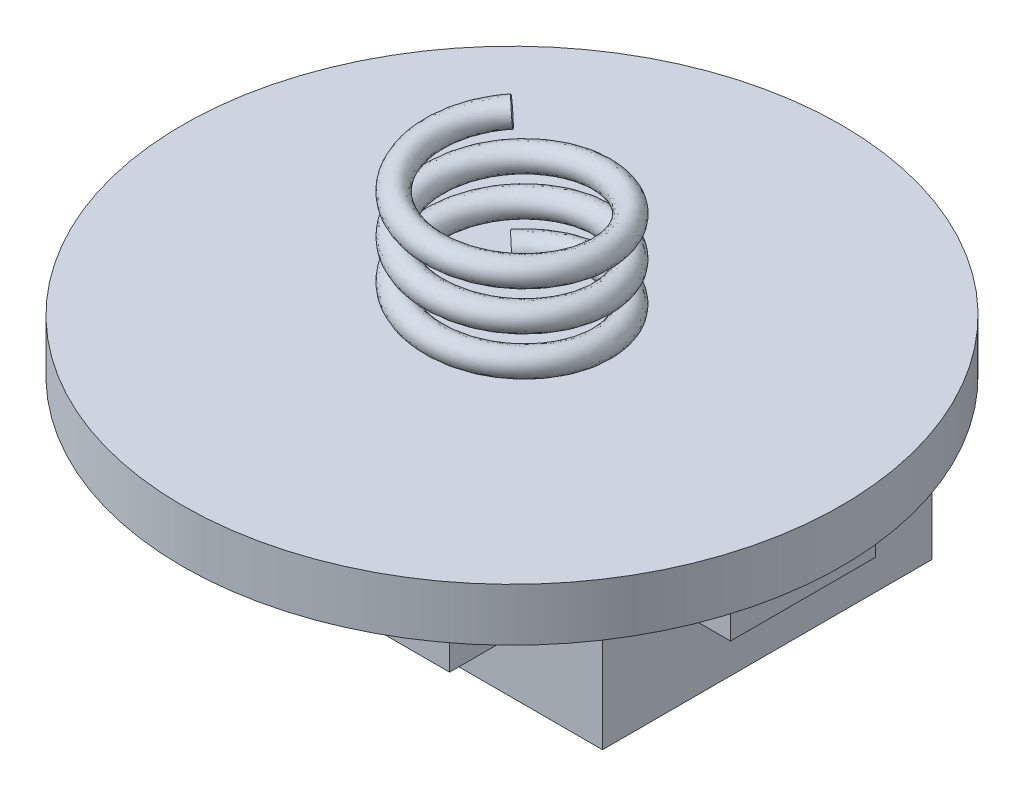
ISO-10303-21;
HEADER;
FILE_DESCRIPTION(('STEP AP214'),'2;1');
FILE_NAME('part.step','',(''),(''),'','','');
FILE_SCHEMA(('AUTOMOTIVE_DESIGN { 1 0 10303 214 1 1 1 1 }'));
ENDSEC;
DATA;
#1=APPLICATION_CONTEXT('core data for automotive mechanical design processes');
#2=APPLICATION_PROTOCOL_DEFINITION('international standard','automotive_design',2000,#1);
#3=PRODUCT_CONTEXT('',#1,'mechanical');
#4=PRODUCT('Part','Part','',(#3));
#5=PRODUCT_RELATED_PRODUCT_CATEGORY('part','',(#4));
#6=PRODUCT_DEFINITION_FORMATION('','',#4);
#7=PRODUCT_DEFINITION_CONTEXT('part definition',#1,'design');
#8=PRODUCT_DEFINITION('design','',#6,#7);
#9=PRODUCT_DEFINITION_SHAPE('','',#8);
#10=(LENGTH_UNIT() NAMED_UNIT(*) SI_UNIT(.MILLI.,.METRE.));
#11=(NAMED_UNIT(*) PLANE_ANGLE_UNIT() SI_UNIT($,.RADIAN.));
#12=(NAMED_UNIT(*) SI_UNIT($,.STERADIAN.) SOLID_ANGLE_UNIT());
#13=UNCERTAINTY_MEASURE_WITH_UNIT(LENGTH_MEASURE(1.E-05),#10,'distance_accuracy_value','');
#14=(GEOMETRIC_REPRESENTATION_CONTEXT(3) GLOBAL_UNCERTAINTY_ASSIGNED_CONTEXT((#13)) GLOBAL_UNIT_ASSIGNED_CONTEXT((#10,
#11,#12)) REPRESENTATION_CONTEXT('',''));
#15=CARTESIAN_POINT('',(0.,0.,0.));
#16=DIRECTION('',(0.,0.,1.));
#17=DIRECTION('',(1.,0.,0.));
#18=AXIS2_PLACEMENT_3D('',#15,#16,#17);
#19=CARTESIAN_POINT('',(5.38446961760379,-1.4478,4.73822887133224));
#20=DIRECTION('',(0.,-1.,0.));
#21=DIRECTION('',(0.,0.,-1.));
#22=AXIS2_PLACEMENT_3D('',#19,#20,#21);
#23=PLANE('',#22);
#24=DIRECTION('',(0.,0.,1.));
#25=VECTOR('',#24,1.);
#26=CARTESIAN_POINT('',(0.99026961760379,-1.4478,7.27822887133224));
#27=LINE('',#26,#25);
#28=CARTESIAN_POINT('',(0.99026961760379,-1.4478,4.73822887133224));
#29=VERTEX_POINT('',#28);
#30=CARTESIAN_POINT('',(0.99026961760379,-1.4478,7.27822887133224));
#31=VERTEX_POINT('',#30);
#32=EDGE_CURVE('E332',#29,#31,#27,.T.);
#33=ORIENTED_EDGE('',*,*,#32,.F.);
#34=DIRECTION('',(-1.,0.,0.));
#35=VECTOR('',#34,1.);
#36=CARTESIAN_POINT('',(0.99026961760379,-1.4478,4.73822887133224));
#37=LINE('',#36,#35);
#38=CARTESIAN_POINT('',(5.38446961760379,-1.4478,4.73822887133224));
#39=VERTEX_POINT('',#38);
#40=EDGE_CURVE('E329',#39,#29,#37,.T.);
#41=ORIENTED_EDGE('',*,*,#40,.F.);
#42=DIRECTION('',(0.,0.,-1.));
#43=VECTOR('',#42,1.);
#44=CARTESIAN_POINT('',(5.38446961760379,-1.4478,7.27822887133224));
#45=LINE('',#44,#43);
#46=CARTESIAN_POINT('',(5.38446961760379,-1.4478,7.27822887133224));
#47=VERTEX_POINT('',#46);
#48=EDGE_CURVE('E323',#47,#39,#45,.T.);
#49=ORIENTED_EDGE('',*,*,#48,.F.);
#50=DIRECTION('',(1.,0.,0.));
#51=VECTOR('',#50,1.);
#52=CARTESIAN_POINT('',(0.99026961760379,-1.4478,7.27822887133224));
#53=LINE('',#52,#51);
#54=EDGE_CURVE('E314',#31,#47,#53,.T.);
#55=ORIENTED_EDGE('',*,*,#54,.F.);
#56=EDGE_LOOP('',(#33,#41,#49,#55));
#57=FACE_BOUND('',#56,.T.);
#58=ADVANCED_FACE('F17',(#57),#23,.T.);
#59=CARTESIAN_POINT('',(-5.38446961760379,-1.4478,7.27822887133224));
#60=DIRECTION('',(0.,-1.,0.));
#61=DIRECTION('',(0.,0.,-1.));
#62=AXIS2_PLACEMENT_3D('',#59,#60,#61);
#63=PLANE('',#62);
#64=DIRECTION('',(-1.,0.,0.));
#65=VECTOR('',#64,1.);
#66=CARTESIAN_POINT('',(-0.99026961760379,-1.4478,4.73822887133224));
#67=LINE('',#66,#65);
#68=CARTESIAN_POINT('',(-0.99026961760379,-1.4478,4.73822887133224));
#69=VERTEX_POINT('',#68);
#70=CARTESIAN_POINT('',(-5.38446961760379,-1.4478,4.73822887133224));
#71=VERTEX_POINT('',#70);
#72=EDGE_CURVE('E309',#69,#71,#67,.T.);
#73=ORIENTED_EDGE('',*,*,#72,.F.);
#74=DIRECTION('',(0.,0.,-1.));
#75=VECTOR('',#74,1.);
#76=CARTESIAN_POINT('',(-0.99026961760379,-1.4478,7.27822887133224));
#77=LINE('',#76,#75);
#78=CARTESIAN_POINT('',(-0.99026961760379,-1.4478,7.27822887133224));
#79=VERTEX_POINT('',#78);
#80=EDGE_CURVE('E306',#79,#69,#77,.T.);
#81=ORIENTED_EDGE('',*,*,#80,.F.);
#82=DIRECTION('',(1.,0.,0.));
#83=VECTOR('',#82,1.);
#84=CARTESIAN_POINT('',(-0.99026961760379,-1.4478,7.27822887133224));
#85=LINE('',#84,#83);
#86=CARTESIAN_POINT('',(-5.38446961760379,-1.4478,7.27822887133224));
#87=VERTEX_POINT('',#86);
#88=EDGE_CURVE('E300',#87,#79,#85,.T.);
#89=ORIENTED_EDGE('',*,*,#88,.F.);
#90=DIRECTION('',(0.,0.,1.));
#91=VECTOR('',#90,1.);
#92=CARTESIAN_POINT('',(-5.38446961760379,-1.4478,7.27822887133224));
#93=LINE('',#92,#91);
#94=EDGE_CURVE('E291',#71,#87,#93,.T.);
#95=ORIENTED_EDGE('',*,*,#94,.F.);
#96=EDGE_LOOP('',(#73,#81,#89,#95));
#97=FACE_BOUND('',#96,.T.);
#98=ADVANCED_FACE('F462',(#97),#63,.T.);
#99=CARTESIAN_POINT('',(-6.28802896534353,-1.4478,-2.1971));
#100=DIRECTION('',(0.,-1.,0.));
#101=DIRECTION('',(0.,0.,-1.));
#102=AXIS2_PLACEMENT_3D('',#99,#100,#101);
#103=PLANE('',#102);
#104=DIRECTION('',(0.,0.,1.));
#105=VECTOR('',#104,1.);
#106=CARTESIAN_POINT('',(-8.82802896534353,-1.4478,2.1971));
#107=LINE('',#106,#105);
#108=CARTESIAN_POINT('',(-8.82802896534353,-1.4478,-2.1971));
#109=VERTEX_POINT('',#108);
#110=CARTESIAN_POINT('',(-8.82802896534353,-1.4478,2.1971));
#111=VERTEX_POINT('',#110);
#112=EDGE_CURVE('E286',#109,#111,#107,.T.);
#113=ORIENTED_EDGE('',*,*,#112,.F.);
#114=DIRECTION('',(-1.,0.,0.));
#115=VECTOR('',#114,1.);
#116=CARTESIAN_POINT('',(-8.82802896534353,-1.4478,-2.1971));
#117=LINE('',#116,#115);
#118=CARTESIAN_POINT('',(-6.28802896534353,-1.4478,-2.1971));
#119=VERTEX_POINT('',#118);
#120=EDGE_CURVE('E283',#119,#109,#117,.T.);
#121=ORIENTED_EDGE('',*,*,#120,.F.);
#122=DIRECTION('',(0.,0.,-1.));
#123=VECTOR('',#122,1.);
#124=CARTESIAN_POINT('',(-6.28802896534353,-1.4478,2.1971));
#125=LINE('',#124,#123);
#126=CARTESIAN_POINT('',(-6.28802896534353,-1.4478,2.1971));
#127=VERTEX_POINT('',#126);
#128=EDGE_CURVE('E277',#127,#119,#125,.T.);
#129=ORIENTED_EDGE('',*,*,#128,.F.);
#130=DIRECTION('',(1.,0.,0.));
#131=VECTOR('',#130,1.);
#132=CARTESIAN_POINT('',(-8.82802896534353,-1.4478,2.1971));
#133=LINE('',#132,#131);
#134=EDGE_CURVE('E268',#111,#127,#133,.T.);
#135=ORIENTED_EDGE('',*,*,#134,.F.);
#136=EDGE_LOOP('',(#113,#121,#129,#135));
#137=FACE_BOUND('',#136,.T.);
#138=ADVANCED_FACE('F459',(#137),#103,.T.);
#139=CARTESIAN_POINT('',(8.82802896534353,-1.4478,-2.1971));
#140=DIRECTION('',(0.,1.,0.));
#141=DIRECTION('',(0.,0.,1.));
#142=AXIS2_PLACEMENT_3D('',#139,#140,#141);
#143=PLANE('',#142);
#144=DIRECTION('',(1.,0.,0.));
#145=VECTOR('',#144,1.);
#146=CARTESIAN_POINT('',(8.82802896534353,-1.4478,2.1971));
#147=LINE('',#146,#145);
#148=CARTESIAN_POINT('',(6.28802896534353,-1.4478,2.1971));
#149=VERTEX_POINT('',#148);
#150=CARTESIAN_POINT('',(8.82802896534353,-1.4478,2.1971));
#151=VERTEX_POINT('',#150);
#152=EDGE_CURVE('E245',#149,#151,#147,.T.);
#153=ORIENTED_EDGE('',*,*,#152,.F.);
#154=DIRECTION('',(0.,0.,1.));
#155=VECTOR('',#154,1.);
#156=CARTESIAN_POINT('',(6.28802896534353,-1.4478,2.1971));
#157=LINE('',#156,#155);
#158=CARTESIAN_POINT('',(6.28802896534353,-1.4478,-2.1971));
#159=VERTEX_POINT('',#158);
#160=EDGE_CURVE('E263',#159,#149,#157,.T.);
#161=ORIENTED_EDGE('',*,*,#160,.F.);
#162=DIRECTION('',(-1.,0.,0.));
#163=VECTOR('',#162,1.);
#164=CARTESIAN_POINT('',(8.82802896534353,-1.4478,-2.1971));
#165=LINE('',#164,#163);
#166=CARTESIAN_POINT('',(8.82802896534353,-1.4478,-2.1971));
#167=VERTEX_POINT('',#166);
#168=EDGE_CURVE('E260',#167,#159,#165,.T.);
#169=ORIENTED_EDGE('',*,*,#168,.F.);
#170=DIRECTION('',(0.,0.,-1.));
#171=VECTOR('',#170,1.);
#172=CARTESIAN_POINT('',(8.82802896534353,-1.4478,2.1971));
#173=LINE('',#172,#171);
#174=EDGE_CURVE('E254',#151,#167,#173,.T.);
#175=ORIENTED_EDGE('',*,*,#174,.F.);
#176=EDGE_LOOP('',(#153,#161,#169,#175));
#177=FACE_BOUND('',#176,.T.);
#178=ADVANCED_FACE('F455',(#177),#143,.F.);
#179=CARTESIAN_POINT('',(0.,-6.,0.));
#180=DIRECTION('',(0.,1.,0.));
#181=DIRECTION('',(0.,0.,1.));
#182=AXIS2_PLACEMENT_3D('',#179,#180,#181);
#183=PLANE('',#182);
#184=DIRECTION('',(-1.,0.,0.));
#185=VECTOR('',#184,1.);
#186=CARTESIAN_POINT('',(5.19118881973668,-6.,2.44526810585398));
#187=LINE('',#186,#185);
#188=CARTESIAN_POINT('',(5.19118881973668,-6.,2.44526810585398));
#189=VERTEX_POINT('',#188);
#190=CARTESIAN_POINT('',(-4.80881118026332,-6.,2.44526810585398));
#191=VERTEX_POINT('',#190);
#192=EDGE_CURVE('E240',#189,#191,#187,.T.);
#193=ORIENTED_EDGE('',*,*,#192,.T.);
#194=DIRECTION('',(0.,0.,-1.));
#195=VECTOR('',#194,1.);
#196=CARTESIAN_POINT('',(-4.80881118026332,-6.,2.44526810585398));
#197=LINE('',#196,#195);
#198=CARTESIAN_POINT('',(-4.80881118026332,-6.,-7.55473189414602));
#199=VERTEX_POINT('',#198);
#200=EDGE_CURVE('E235',#191,#199,#197,.T.);
#201=ORIENTED_EDGE('',*,*,#200,.T.);
#202=DIRECTION('',(1.,0.,0.));
#203=VECTOR('',#202,1.);
#204=CARTESIAN_POINT('',(5.19118881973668,-6.,-7.55473189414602));
#205=LINE('',#204,#203);
#206=CARTESIAN_POINT('',(5.19118881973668,-6.,-7.55473189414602));
#207=VERTEX_POINT('',#206);
#208=EDGE_CURVE('E182',#199,#207,#205,.T.);
#209=ORIENTED_EDGE('',*,*,#208,.T.);
#210=DIRECTION('',(0.,0.,1.));
#211=VECTOR('',#210,1.);
#212=CARTESIAN_POINT('',(5.19118881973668,-6.,2.44526810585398));
#213=LINE('',#212,#211);
#214=EDGE_CURVE('E181',#207,#189,#213,.T.);
#215=ORIENTED_EDGE('',*,*,#214,.T.);
#216=EDGE_LOOP('',(#193,#201,#209,#215));
#217=FACE_BOUND('',#216,.T.);
#218=ADVANCED_FACE('F451',(#217),#183,.F.);
#219=CARTESIAN_POINT('',(0.99026961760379,-1.4478,7.27822887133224));
#220=DIRECTION('',(-1.,0.,0.));
#221=DIRECTION('',(0.,0.,1.));
#222=AXIS2_PLACEMENT_3D('',#219,#220,#221);
#223=PLANE('',#222);
#224=ORIENTED_EDGE('',*,*,#32,.T.);
#225=DIRECTION('',(0.,1.,0.));
#226=VECTOR('',#225,1.);
#227=CARTESIAN_POINT('',(0.99026961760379,-1.4478,7.27822887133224));
#228=LINE('',#227,#226);
#229=CARTESIAN_POINT('',(0.99026961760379,0.,7.27822887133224));
#230=VERTEX_POINT('',#229);
#231=EDGE_CURVE('E317',#230,#31,#228,.F.);
#232=ORIENTED_EDGE('',*,*,#231,.F.);
#233=DIRECTION('',(0.,0.,1.));
#234=VECTOR('',#233,1.);
#235=CARTESIAN_POINT('',(0.99026961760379,0.,0.));
#236=LINE('',#235,#234);
#237=CARTESIAN_POINT('',(0.99026961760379,0.,4.73822887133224));
#238=VERTEX_POINT('',#237);
#239=EDGE_CURVE('E228',#230,#238,#236,.F.);
#240=ORIENTED_EDGE('',*,*,#239,.T.);
#241=DIRECTION('',(0.,1.,0.));
#242=VECTOR('',#241,1.);
#243=CARTESIAN_POINT('',(0.99026961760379,-1.4478,4.73822887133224));
#244=LINE('',#243,#242);
#245=EDGE_CURVE('E326',#29,#238,#244,.T.);
#246=ORIENTED_EDGE('',*,*,#245,.F.);
#247=EDGE_LOOP('',(#224,#232,#240,#246));
#248=FACE_BOUND('',#247,.T.);
#249=ADVANCED_FACE('F447',(#248),#223,.T.);
#250=CARTESIAN_POINT('',(0.99026961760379,-1.4478,4.73822887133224));
#251=DIRECTION('',(0.,0.,-1.));
#252=DIRECTION('',(-1.,0.,0.));
#253=AXIS2_PLACEMENT_3D('',#250,#251,#252);
#254=PLANE('',#253);
#255=ORIENTED_EDGE('',*,*,#40,.T.);
#256=ORIENTED_EDGE('',*,*,#245,.T.);
#257=DIRECTION('',(1.,0.,0.));
#258=VECTOR('',#257,1.);
#259=CARTESIAN_POINT('',(0.,0.,4.73822887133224));
#260=LINE('',#259,#258);
#261=CARTESIAN_POINT('',(5.38446961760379,0.,4.73822887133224));
#262=VERTEX_POINT('',#261);
#263=EDGE_CURVE('E226',#238,#262,#260,.T.);
#264=ORIENTED_EDGE('',*,*,#263,.T.);
#265=DIRECTION('',(0.,1.,0.));
#266=VECTOR('',#265,1.);
#267=CARTESIAN_POINT('',(5.38446961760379,-1.4478,4.73822887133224));
#268=LINE('',#267,#266);
#269=EDGE_CURVE('E320',#39,#262,#268,.T.);
#270=ORIENTED_EDGE('',*,*,#269,.F.);
#271=EDGE_LOOP('',(#255,#256,#264,#270));
#272=FACE_BOUND('',#271,.T.);
#273=ADVANCED_FACE('F443',(#272),#254,.T.);
#274=CARTESIAN_POINT('',(5.38446961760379,-1.4478,7.27822887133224));
#275=DIRECTION('',(1.,0.,0.));
#276=DIRECTION('',(0.,0.,-1.));
#277=AXIS2_PLACEMENT_3D('',#274,#275,#276);
#278=PLANE('',#277);
#279=ORIENTED_EDGE('',*,*,#48,.T.);
#280=ORIENTED_EDGE('',*,*,#269,.T.);
#281=DIRECTION('',(0.,0.,1.));
#282=VECTOR('',#281,1.);
#283=CARTESIAN_POINT('',(5.38446961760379,0.,0.));
#284=LINE('',#283,#282);
#285=CARTESIAN_POINT('',(5.38446961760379,0.,7.27822887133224));
#286=VERTEX_POINT('',#285);
#287=EDGE_CURVE('E224',#262,#286,#284,.T.);
#288=ORIENTED_EDGE('',*,*,#287,.T.);
#289=DIRECTION('',(0.,1.,0.));
#290=VECTOR('',#289,1.);
#291=CARTESIAN_POINT('',(5.38446961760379,-1.4478,7.27822887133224));
#292=LINE('',#291,#290);
#293=EDGE_CURVE('E311',#47,#286,#292,.T.);
#294=ORIENTED_EDGE('',*,*,#293,.F.);
#295=EDGE_LOOP('',(#279,#280,#288,#294));
#296=FACE_BOUND('',#295,.T.);
#297=ADVANCED_FACE('F439',(#296),#278,.T.);
#298=CARTESIAN_POINT('',(0.99026961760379,-1.4478,7.27822887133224));
#299=DIRECTION('',(0.,0.,1.));
#300=DIRECTION('',(1.,0.,0.));
#301=AXIS2_PLACEMENT_3D('',#298,#299,#300);
#302=PLANE('',#301);
#303=ORIENTED_EDGE('',*,*,#54,.T.);
#304=ORIENTED_EDGE('',*,*,#293,.T.);
#305=DIRECTION('',(1.,0.,0.));
#306=VECTOR('',#305,1.);
#307=CARTESIAN_POINT('',(0.,0.,7.27822887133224));
#308=LINE('',#307,#306);
#309=EDGE_CURVE('E221',#286,#230,#308,.F.);
#310=ORIENTED_EDGE('',*,*,#309,.T.);
#311=ORIENTED_EDGE('',*,*,#231,.T.);
#312=EDGE_LOOP('',(#303,#304,#310,#311));
#313=FACE_BOUND('',#312,.T.);
#314=ADVANCED_FACE('F435',(#313),#302,.T.);
#315=CARTESIAN_POINT('',(-0.99026961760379,-1.4478,4.73822887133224));
#316=DIRECTION('',(0.,0.,-1.));
#317=DIRECTION('',(-1.,0.,0.));
#318=AXIS2_PLACEMENT_3D('',#315,#316,#317);
#319=PLANE('',#318);
#320=ORIENTED_EDGE('',*,*,#72,.T.);
#321=DIRECTION('',(0.,1.,0.));
#322=VECTOR('',#321,1.);
#323=CARTESIAN_POINT('',(-5.38446961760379,-1.4478,4.73822887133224));
#324=LINE('',#323,#322);
#325=CARTESIAN_POINT('',(-5.38446961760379,0.,4.73822887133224));
#326=VERTEX_POINT('',#325);
#327=EDGE_CURVE('E294',#326,#71,#324,.F.);
#328=ORIENTED_EDGE('',*,*,#327,.F.);
#329=DIRECTION('',(1.,0.,0.));
#330=VECTOR('',#329,1.);
#331=CARTESIAN_POINT('',(0.,0.,4.73822887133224));
#332=LINE('',#331,#330);
#333=CARTESIAN_POINT('',(-0.99026961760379,0.,4.73822887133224));
#334=VERTEX_POINT('',#333);
#335=EDGE_CURVE('E219',#326,#334,#332,.T.);
#336=ORIENTED_EDGE('',*,*,#335,.T.);
#337=DIRECTION('',(0.,1.,0.));
#338=VECTOR('',#337,1.);
#339=CARTESIAN_POINT('',(-0.99026961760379,-1.4478,4.73822887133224));
#340=LINE('',#339,#338);
#341=EDGE_CURVE('E303',#69,#334,#340,.T.);
#342=ORIENTED_EDGE('',*,*,#341,.F.);
#343=EDGE_LOOP('',(#320,#328,#336,#342));
#344=FACE_BOUND('',#343,.T.);
#345=ADVANCED_FACE('F431',(#344),#319,.T.);
#346=CARTESIAN_POINT('',(-0.99026961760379,-1.4478,7.27822887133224));
#347=DIRECTION('',(1.,0.,0.));
#348=DIRECTION('',(0.,0.,-1.));
#349=AXIS2_PLACEMENT_3D('',#346,#347,#348);
#350=PLANE('',#349);
#351=ORIENTED_EDGE('',*,*,#80,.T.);
#352=ORIENTED_EDGE('',*,*,#341,.T.);
#353=DIRECTION('',(0.,0.,1.));
#354=VECTOR('',#353,1.);
#355=CARTESIAN_POINT('',(-0.99026961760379,0.,0.));
#356=LINE('',#355,#354);
#357=CARTESIAN_POINT('',(-0.99026961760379,0.,7.27822887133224));
#358=VERTEX_POINT('',#357);
#359=EDGE_CURVE('E217',#334,#358,#356,.T.);
#360=ORIENTED_EDGE('',*,*,#359,.T.);
#361=DIRECTION('',(0.,1.,0.));
#362=VECTOR('',#361,1.);
#363=CARTESIAN_POINT('',(-0.99026961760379,-1.4478,7.27822887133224));
#364=LINE('',#363,#362);
#365=EDGE_CURVE('E297',#79,#358,#364,.T.);
#366=ORIENTED_EDGE('',*,*,#365,.F.);
#367=EDGE_LOOP('',(#351,#352,#360,#366));
#368=FACE_BOUND('',#367,.T.);
#369=ADVANCED_FACE('F427',(#368),#350,.T.);
#370=CARTESIAN_POINT('',(-0.99026961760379,-1.4478,7.27822887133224));
#371=DIRECTION('',(0.,0.,1.));
#372=DIRECTION('',(1.,0.,0.));
#373=AXIS2_PLACEMENT_3D('',#370,#371,#372);
#374=PLANE('',#373);
#375=ORIENTED_EDGE('',*,*,#88,.T.);
#376=ORIENTED_EDGE('',*,*,#365,.T.);
#377=DIRECTION('',(1.,0.,0.));
#378=VECTOR('',#377,1.);
#379=CARTESIAN_POINT('',(0.,0.,7.27822887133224));
#380=LINE('',#379,#378);
#381=CARTESIAN_POINT('',(-5.38446961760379,0.,7.27822887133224));
#382=VERTEX_POINT('',#381);
#383=EDGE_CURVE('E215',#358,#382,#380,.F.);
#384=ORIENTED_EDGE('',*,*,#383,.T.);
#385=DIRECTION('',(0.,1.,0.));
#386=VECTOR('',#385,1.);
#387=CARTESIAN_POINT('',(-5.38446961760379,-1.4478,7.27822887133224));
#388=LINE('',#387,#386);
#389=EDGE_CURVE('E288',#87,#382,#388,.T.);
#390=ORIENTED_EDGE('',*,*,#389,.F.);
#391=EDGE_LOOP('',(#375,#376,#384,#390));
#392=FACE_BOUND('',#391,.T.);
#393=ADVANCED_FACE('F423',(#392),#374,.T.);
#394=CARTESIAN_POINT('',(-5.38446961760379,-1.4478,7.27822887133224));
#395=DIRECTION('',(-1.,0.,0.));
#396=DIRECTION('',(0.,0.,1.));
#397=AXIS2_PLACEMENT_3D('',#394,#395,#396);
#398=PLANE('',#397);
#399=ORIENTED_EDGE('',*,*,#94,.T.);
#400=ORIENTED_EDGE('',*,*,#389,.T.);
#401=DIRECTION('',(0.,0.,1.));
#402=VECTOR('',#401,1.);
#403=CARTESIAN_POINT('',(-5.38446961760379,0.,0.));
#404=LINE('',#403,#402);
#405=EDGE_CURVE('E212',#382,#326,#404,.F.);
#406=ORIENTED_EDGE('',*,*,#405,.T.);
#407=ORIENTED_EDGE('',*,*,#327,.T.);
#408=EDGE_LOOP('',(#399,#400,#406,#407));
#409=FACE_BOUND('',#408,.T.);
#410=ADVANCED_FACE('F419',(#409),#398,.T.);
#411=CARTESIAN_POINT('',(-8.82802896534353,-1.4478,2.1971));
#412=DIRECTION('',(-1.,0.,0.));
#413=DIRECTION('',(0.,0.,1.));
#414=AXIS2_PLACEMENT_3D('',#411,#412,#413);
#415=PLANE('',#414);
#416=ORIENTED_EDGE('',*,*,#112,.T.);
#417=DIRECTION('',(0.,1.,0.));
#418=VECTOR('',#417,1.);
#419=CARTESIAN_POINT('',(-8.82802896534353,-1.4478,2.1971));
#420=LINE('',#419,#418);
#421=CARTESIAN_POINT('',(-8.82802896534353,0.,2.1971));
#422=VERTEX_POINT('',#421);
#423=EDGE_CURVE('E271',#422,#111,#420,.F.);
#424=ORIENTED_EDGE('',*,*,#423,.F.);
#425=DIRECTION('',(0.,0.,1.));
#426=VECTOR('',#425,1.);
#427=CARTESIAN_POINT('',(-8.82802896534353,0.,0.));
#428=LINE('',#427,#426);
#429=CARTESIAN_POINT('',(-8.82802896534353,0.,-2.1971));
#430=VERTEX_POINT('',#429);
#431=EDGE_CURVE('E210',#422,#430,#428,.F.);
#432=ORIENTED_EDGE('',*,*,#431,.T.);
#433=DIRECTION('',(0.,1.,0.));
#434=VECTOR('',#433,1.);
#435=CARTESIAN_POINT('',(-8.82802896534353,-1.4478,-2.1971));
#436=LINE('',#435,#434);
#437=EDGE_CURVE('E280',#109,#430,#436,.T.);
#438=ORIENTED_EDGE('',*,*,#437,.F.);
#439=EDGE_LOOP('',(#416,#424,#432,#438));
#440=FACE_BOUND('',#439,.T.);
#441=ADVANCED_FACE('F415',(#440),#415,.T.);
#442=CARTESIAN_POINT('',(-8.82802896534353,-1.4478,-2.1971));
#443=DIRECTION('',(0.,0.,-1.));
#444=DIRECTION('',(-1.,0.,0.));
#445=AXIS2_PLACEMENT_3D('',#442,#443,#444);
#446=PLANE('',#445);
#447=ORIENTED_EDGE('',*,*,#120,.T.);
#448=ORIENTED_EDGE('',*,*,#437,.T.);
#449=DIRECTION('',(1.,0.,0.));
#450=VECTOR('',#449,1.);
#451=CARTESIAN_POINT('',(0.,0.,-2.1971));
#452=LINE('',#451,#450);
#453=CARTESIAN_POINT('',(-6.28802896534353,0.,-2.1971));
#454=VERTEX_POINT('',#453);
#455=EDGE_CURVE('E208',#430,#454,#452,.T.);
#456=ORIENTED_EDGE('',*,*,#455,.T.);
#457=DIRECTION('',(0.,1.,0.));
#458=VECTOR('',#457,1.);
#459=CARTESIAN_POINT('',(-6.28802896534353,-1.4478,-2.1971));
#460=LINE('',#459,#458);
#461=EDGE_CURVE('E274',#119,#454,#460,.T.);
#462=ORIENTED_EDGE('',*,*,#461,.F.);
#463=EDGE_LOOP('',(#447,#448,#456,#462));
#464=FACE_BOUND('',#463,.T.);
#465=ADVANCED_FACE('F411',(#464),#446,.T.);
#466=CARTESIAN_POINT('',(-6.28802896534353,-1.4478,2.1971));
#467=DIRECTION('',(1.,0.,0.));
#468=DIRECTION('',(0.,0.,-1.));
#469=AXIS2_PLACEMENT_3D('',#466,#467,#468);
#470=PLANE('',#469);
#471=ORIENTED_EDGE('',*,*,#128,.T.);
#472=ORIENTED_EDGE('',*,*,#461,.T.);
#473=DIRECTION('',(0.,0.,1.));
#474=VECTOR('',#473,1.);
#475=CARTESIAN_POINT('',(-6.28802896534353,0.,0.));
#476=LINE('',#475,#474);
#477=CARTESIAN_POINT('',(-6.28802896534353,0.,2.1971));
#478=VERTEX_POINT('',#477);
#479=EDGE_CURVE('E206',#454,#478,#476,.T.);
#480=ORIENTED_EDGE('',*,*,#479,.T.);
#481=DIRECTION('',(0.,1.,0.));
#482=VECTOR('',#481,1.);
#483=CARTESIAN_POINT('',(-6.28802896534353,-1.4478,2.1971));
#484=LINE('',#483,#482);
#485=EDGE_CURVE('E265',#127,#478,#484,.T.);
#486=ORIENTED_EDGE('',*,*,#485,.F.);
#487=EDGE_LOOP('',(#471,#472,#480,#486));
#488=FACE_BOUND('',#487,.T.);
#489=ADVANCED_FACE('F407',(#488),#470,.T.);
#490=CARTESIAN_POINT('',(-8.82802896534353,-1.4478,2.1971));
#491=DIRECTION('',(0.,0.,1.));
#492=DIRECTION('',(1.,0.,0.));
#493=AXIS2_PLACEMENT_3D('',#490,#491,#492);
#494=PLANE('',#493);
#495=ORIENTED_EDGE('',*,*,#134,.T.);
#496=ORIENTED_EDGE('',*,*,#485,.T.);
#497=DIRECTION('',(1.,0.,0.));
#498=VECTOR('',#497,1.);
#499=CARTESIAN_POINT('',(0.,0.,2.1971));
#500=LINE('',#499,#498);
#501=EDGE_CURVE('E203',#478,#422,#500,.F.);
#502=ORIENTED_EDGE('',*,*,#501,.T.);
#503=ORIENTED_EDGE('',*,*,#423,.T.);
#504=EDGE_LOOP('',(#495,#496,#502,#503));
#505=FACE_BOUND('',#504,.T.);
#506=ADVANCED_FACE('F403',(#505),#494,.T.);
#507=CARTESIAN_POINT('',(6.28802896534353,-1.4478,2.1971));
#508=DIRECTION('',(-1.,0.,0.));
#509=DIRECTION('',(0.,0.,1.));
#510=AXIS2_PLACEMENT_3D('',#507,#508,#509);
#511=PLANE('',#510);
#512=ORIENTED_EDGE('',*,*,#160,.T.);
#513=DIRECTION('',(0.,1.,0.));
#514=VECTOR('',#513,1.);
#515=CARTESIAN_POINT('',(6.28802896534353,-1.4478,2.1971));
#516=LINE('',#515,#514);
#517=CARTESIAN_POINT('',(6.28802896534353,0.,2.1971));
#518=VERTEX_POINT('',#517);
#519=EDGE_CURVE('E248',#518,#149,#516,.F.);
#520=ORIENTED_EDGE('',*,*,#519,.F.);
#521=DIRECTION('',(0.,0.,1.));
#522=VECTOR('',#521,1.);
#523=CARTESIAN_POINT('',(6.28802896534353,0.,0.));
#524=LINE('',#523,#522);
#525=CARTESIAN_POINT('',(6.28802896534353,0.,-2.1971));
#526=VERTEX_POINT('',#525);
#527=EDGE_CURVE('E201',#518,#526,#524,.F.);
#528=ORIENTED_EDGE('',*,*,#527,.T.);
#529=DIRECTION('',(0.,1.,0.));
#530=VECTOR('',#529,1.);
#531=CARTESIAN_POINT('',(6.28802896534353,-1.4478,-2.1971));
#532=LINE('',#531,#530);
#533=EDGE_CURVE('E257',#159,#526,#532,.T.);
#534=ORIENTED_EDGE('',*,*,#533,.F.);
#535=EDGE_LOOP('',(#512,#520,#528,#534));
#536=FACE_BOUND('',#535,.T.);
#537=ADVANCED_FACE('F399',(#536),#511,.T.);
#538=CARTESIAN_POINT('',(8.82802896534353,-1.4478,-2.1971));
#539=DIRECTION('',(0.,0.,-1.));
#540=DIRECTION('',(-1.,0.,0.));
#541=AXIS2_PLACEMENT_3D('',#538,#539,#540);
#542=PLANE('',#541);
#543=ORIENTED_EDGE('',*,*,#168,.T.);
#544=ORIENTED_EDGE('',*,*,#533,.T.);
#545=DIRECTION('',(1.,0.,0.));
#546=VECTOR('',#545,1.);
#547=CARTESIAN_POINT('',(0.,0.,-2.1971));
#548=LINE('',#547,#546);
#549=CARTESIAN_POINT('',(8.82802896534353,0.,-2.1971));
#550=VERTEX_POINT('',#549);
#551=EDGE_CURVE('E199',#526,#550,#548,.T.);
#552=ORIENTED_EDGE('',*,*,#551,.T.);
#553=DIRECTION('',(0.,1.,0.));
#554=VECTOR('',#553,1.);
#555=CARTESIAN_POINT('',(8.82802896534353,-1.4478,-2.1971));
#556=LINE('',#555,#554);
#557=EDGE_CURVE('E251',#167,#550,#556,.T.);
#558=ORIENTED_EDGE('',*,*,#557,.F.);
#559=EDGE_LOOP('',(#543,#544,#552,#558));
#560=FACE_BOUND('',#559,.T.);
#561=ADVANCED_FACE('F395',(#560),#542,.T.);
#562=CARTESIAN_POINT('',(8.82802896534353,-1.4478,2.1971));
#563=DIRECTION('',(1.,0.,0.));
#564=DIRECTION('',(0.,0.,-1.));
#565=AXIS2_PLACEMENT_3D('',#562,#563,#564);
#566=PLANE('',#565);
#567=ORIENTED_EDGE('',*,*,#174,.T.);
#568=ORIENTED_EDGE('',*,*,#557,.T.);
#569=DIRECTION('',(0.,0.,1.));
#570=VECTOR('',#569,1.);
#571=CARTESIAN_POINT('',(8.82802896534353,0.,0.));
#572=LINE('',#571,#570);
#573=CARTESIAN_POINT('',(8.82802896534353,0.,2.1971));
#574=VERTEX_POINT('',#573);
#575=EDGE_CURVE('E197',#550,#574,#572,.T.);
#576=ORIENTED_EDGE('',*,*,#575,.T.);
#577=DIRECTION('',(0.,1.,0.));
#578=VECTOR('',#577,1.);
#579=CARTESIAN_POINT('',(8.82802896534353,-1.4478,2.1971));
#580=LINE('',#579,#578);
#581=EDGE_CURVE('E242',#151,#574,#580,.T.);
#582=ORIENTED_EDGE('',*,*,#581,.F.);
#583=EDGE_LOOP('',(#567,#568,#576,#582));
#584=FACE_BOUND('',#583,.T.);
#585=ADVANCED_FACE('F391',(#584),#566,.T.);
#586=CARTESIAN_POINT('',(8.82802896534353,-1.4478,2.1971));
#587=DIRECTION('',(0.,0.,1.));
#588=DIRECTION('',(1.,0.,0.));
#589=AXIS2_PLACEMENT_3D('',#586,#587,#588);
#590=PLANE('',#589);
#591=ORIENTED_EDGE('',*,*,#152,.T.);
#592=ORIENTED_EDGE('',*,*,#581,.T.);
#593=DIRECTION('',(1.,0.,0.));
#594=VECTOR('',#593,1.);
#595=CARTESIAN_POINT('',(0.,0.,2.1971));
#596=LINE('',#595,#594);
#597=EDGE_CURVE('E194',#574,#518,#596,.F.);
#598=ORIENTED_EDGE('',*,*,#597,.T.);
#599=ORIENTED_EDGE('',*,*,#519,.T.);
#600=EDGE_LOOP('',(#591,#592,#598,#599));
#601=FACE_BOUND('',#600,.T.);
#602=ADVANCED_FACE('F387',(#601),#590,.T.);
#603=CARTESIAN_POINT('',(5.19118881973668,-6.,2.44526810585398));
#604=DIRECTION('',(0.,0.,-1.));
#605=DIRECTION('',(-1.,0.,0.));
#606=AXIS2_PLACEMENT_3D('',#603,#604,#605);
#607=PLANE('',#606);
#608=DIRECTION('',(0.,1.,0.));
#609=VECTOR('',#608,1.);
#610=CARTESIAN_POINT('',(-4.80881118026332,-6.,2.44526810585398));
#611=LINE('',#610,#609);
#612=CARTESIAN_POINT('',(-4.80881118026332,0.,2.44526810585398));
#613=VERTEX_POINT('',#612);
#614=EDGE_CURVE('E237',#613,#191,#611,.F.);
#615=ORIENTED_EDGE('',*,*,#614,.T.);
#616=ORIENTED_EDGE('',*,*,#192,.F.);
#617=DIRECTION('',(0.,1.,0.));
#618=VECTOR('',#617,1.);
#619=CARTESIAN_POINT('',(5.19118881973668,-6.,2.44526810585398));
#620=LINE('',#619,#618);
#621=CARTESIAN_POINT('',(5.19118881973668,0.,2.44526810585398));
#622=VERTEX_POINT('',#621);
#623=EDGE_CURVE('E230',#189,#622,#620,.T.);
#624=ORIENTED_EDGE('',*,*,#623,.T.);
#625=DIRECTION('',(1.,0.,0.));
#626=VECTOR('',#625,1.);
#627=CARTESIAN_POINT('',(0.,0.,2.44526810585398));
#628=LINE('',#627,#626);
#629=EDGE_CURVE('E186',#622,#613,#628,.F.);
#630=ORIENTED_EDGE('',*,*,#629,.T.);
#631=EDGE_LOOP('',(#615,#616,#624,#630));
#632=FACE_BOUND('',#631,.T.);
#633=ADVANCED_FACE('F383',(#632),#607,.F.);
#634=CARTESIAN_POINT('',(-4.80881118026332,-6.,2.44526810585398));
#635=DIRECTION('',(1.,0.,0.));
#636=DIRECTION('',(0.,0.,-1.));
#637=AXIS2_PLACEMENT_3D('',#634,#635,#636);
#638=PLANE('',#637);
#639=DIRECTION('',(0.,1.,0.));
#640=VECTOR('',#639,1.);
#641=CARTESIAN_POINT('',(-4.80881118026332,-6.,-7.55473189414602));
#642=LINE('',#641,#640);
#643=CARTESIAN_POINT('',(-4.80881118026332,0.,-7.55473189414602));
#644=VERTEX_POINT('',#643);
#645=EDGE_CURVE('E169',#644,#199,#642,.F.);
#646=ORIENTED_EDGE('',*,*,#645,.T.);
#647=ORIENTED_EDGE('',*,*,#200,.F.);
#648=ORIENTED_EDGE('',*,*,#614,.F.);
#649=DIRECTION('',(0.,0.,1.));
#650=VECTOR('',#649,1.);
#651=CARTESIAN_POINT('',(-4.80881118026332,0.,0.));
#652=LINE('',#651,#650);
#653=EDGE_CURVE('E174',#613,#644,#652,.F.);
#654=ORIENTED_EDGE('',*,*,#653,.T.);
#655=EDGE_LOOP('',(#646,#647,#648,#654));
#656=FACE_BOUND('',#655,.T.);
#657=ADVANCED_FACE('F380',(#656),#638,.F.);
#658=CARTESIAN_POINT('',(5.19118881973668,-6.,-7.55473189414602));
#659=DIRECTION('',(0.,0.,1.));
#660=DIRECTION('',(1.,0.,0.));
#661=AXIS2_PLACEMENT_3D('',#658,#659,#660);
#662=PLANE('',#661);
#663=DIRECTION('',(0.,1.,0.));
#664=VECTOR('',#663,1.);
#665=CARTESIAN_POINT('',(5.19118881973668,-6.,-7.55473189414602));
#666=LINE('',#665,#664);
#667=CARTESIAN_POINT('',(5.19118881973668,0.,-7.55473189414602));
#668=VERTEX_POINT('',#667);
#669=EDGE_CURVE('E166',#668,#207,#666,.F.);
#670=ORIENTED_EDGE('',*,*,#669,.T.);
#671=ORIENTED_EDGE('',*,*,#208,.F.);
#672=ORIENTED_EDGE('',*,*,#645,.F.);
#673=DIRECTION('',(1.,0.,0.));
#674=VECTOR('',#673,1.);
#675=CARTESIAN_POINT('',(0.,0.,-7.55473189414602));
#676=LINE('',#675,#674);
#677=EDGE_CURVE('E162',#644,#668,#676,.T.);
#678=ORIENTED_EDGE('',*,*,#677,.T.);
#679=EDGE_LOOP('',(#670,#671,#672,#678));
#680=FACE_BOUND('',#679,.T.);
#681=ADVANCED_FACE('F164',(#680),#662,.F.);
#682=CARTESIAN_POINT('',(5.19118881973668,-6.,2.44526810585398));
#683=DIRECTION('',(-1.,0.,0.));
#684=DIRECTION('',(0.,0.,1.));
#685=AXIS2_PLACEMENT_3D('',#682,#683,#684);
#686=PLANE('',#685);
#687=ORIENTED_EDGE('',*,*,#623,.F.);
#688=ORIENTED_EDGE('',*,*,#214,.F.);
#689=ORIENTED_EDGE('',*,*,#669,.F.);
#690=DIRECTION('',(0.,0.,1.));
#691=VECTOR('',#690,1.);
#692=CARTESIAN_POINT('',(5.19118881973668,0.,0.));
#693=LINE('',#692,#691);
#694=EDGE_CURVE('E173',#668,#622,#693,.T.);
#695=ORIENTED_EDGE('',*,*,#694,.T.);
#696=EDGE_LOOP('',(#687,#688,#689,#695));
#697=FACE_BOUND('',#696,.T.);
#698=ADVANCED_FACE('F179',(#697),#686,.F.);
#699=CARTESIAN_POINT('',(-1.52693659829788,5.15630496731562,-1.52692557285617));
#700=DIRECTION('',(-0.705164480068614,-0.0740682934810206,0.705164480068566));
#701=DIRECTION('',(0.707106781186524,0.,0.707106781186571));
#702=AXIS2_PLACEMENT_3D('',#699,#700,#701);
#703=PLANE('',#702);
#704=CARTESIAN_POINT('',(-1.52693659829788,5.15630496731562,-1.52692557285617));
#705=CARTESIAN_POINT('',(-1.52805673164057,5.17766409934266,-1.52580220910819));
#706=CARTESIAN_POINT('',(-1.53045804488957,5.19900929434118,-1.52596148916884));
#707=CARTESIAN_POINT('',(-1.53775420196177,5.24112725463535,-1.52883370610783));
#708=CARTESIAN_POINT('',(-1.542652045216,5.26189929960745,-1.53154971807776));
#709=CARTESIAN_POINT('',(-1.55479712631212,5.30221803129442,-1.53945984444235));
#710=CARTESIAN_POINT('',(-1.56204132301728,5.32176626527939,-1.54465075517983));
#711=CARTESIAN_POINT('',(-1.57868676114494,5.35914100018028,-1.55737046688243));
#712=CARTESIAN_POINT('',(-1.58809096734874,5.37696508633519,-1.56490248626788));
#713=CARTESIAN_POINT('',(-1.60876911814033,5.41033008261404,-1.58207608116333));
#714=CARTESIAN_POINT('',(-1.62004045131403,5.42587412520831,-1.59171471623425));
#715=CARTESIAN_POINT('',(-1.6441594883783,5.45428812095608,-1.61284923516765));
#716=CARTESIAN_POINT('',(-1.65700937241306,5.467154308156,-1.62434769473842));
#717=CARTESIAN_POINT('',(-1.6838887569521,5.48980338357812,-1.64884809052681));
#718=CARTESIAN_POINT('',(-1.69791658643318,5.4995905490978,-1.66184790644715));
#719=CARTESIAN_POINT('',(-1.72679005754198,5.51584005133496,-1.68901458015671));
#720=CARTESIAN_POINT('',(-1.7416368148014,5.52229772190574,-1.70318304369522));
#721=CARTESIAN_POINT('',(-1.77168690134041,5.53167730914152,-1.73224792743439));
#722=CARTESIAN_POINT('',(-1.78688970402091,5.53460414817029,-1.74714330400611));
#723=CARTESIAN_POINT('',(-1.81726234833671,5.53685712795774,-1.77727930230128));
#724=CARTESIAN_POINT('',(-1.83243211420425,5.53617823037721,-1.79252037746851));
#725=CARTESIAN_POINT('',(-1.86226497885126,5.53123085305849,-1.82287289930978));
#726=CARTESIAN_POINT('',(-1.87692875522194,5.52696738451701,-1.83798449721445));
#727=CARTESIAN_POINT('',(-1.90537628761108,5.5149698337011,-1.86769221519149));
#728=CARTESIAN_POINT('',(-1.91915878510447,5.50723090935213,-1.88228758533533));
#729=CARTESIAN_POINT('',(-1.94541100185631,5.48851434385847,-1.91050573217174));
#730=CARTESIAN_POINT('',(-1.9578825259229,5.47754123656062,-1.92412983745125));
#731=CARTESIAN_POINT('',(-1.98119770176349,5.45264578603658,-1.9500599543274));
#732=CARTESIAN_POINT('',(-1.9920390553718,5.43871934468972,-1.96236409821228));
#733=CARTESIAN_POINT('',(-2.01175084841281,5.40834379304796,-1.98526644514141));
#734=CARTESIAN_POINT('',(-2.02062402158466,5.39189823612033,-1.99586700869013));
#735=CARTESIAN_POINT('',(-2.03617824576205,5.35691167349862,-2.01509611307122));
#736=CARTESIAN_POINT('',(-2.04285620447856,5.33836776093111,-2.02372186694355));
#737=CARTESIAN_POINT('',(-2.05380454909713,5.29976031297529,-2.03872541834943));
#738=CARTESIAN_POINT('',(-2.0580786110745,5.2796991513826,-2.04510664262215));
#739=CARTESIAN_POINT('',(-2.06411892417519,5.23856622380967,-2.05546743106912));
#740=CARTESIAN_POINT('',(-2.06588097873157,5.21749282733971,-2.05944296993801));
#741=CARTESIAN_POINT('',(-2.06683365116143,5.17496581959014,-2.06486254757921));
#742=CARTESIAN_POINT('',(-2.06602426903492,5.15351220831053,-2.06630658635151));
#743=CARTESIAN_POINT('',(-2.06186064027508,5.11087051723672,-2.06662190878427));
#744=CARTESIAN_POINT('',(-2.0585106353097,5.08968205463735,-2.06549747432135));
#745=CARTESIAN_POINT('',(-2.04935860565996,5.04810254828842,-2.06071282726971));
#746=CARTESIAN_POINT('',(-2.04355282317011,5.02771277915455,-2.05704872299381));
#747=CARTESIAN_POINT('',(-2.02966363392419,4.98837268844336,-2.04729169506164));
#748=CARTESIAN_POINT('',(-2.02158342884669,4.96942039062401,-2.04120218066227));
#749=CARTESIAN_POINT('',(-2.00335821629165,4.93343544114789,-2.02675671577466));
#750=CARTESIAN_POINT('',(-1.99321033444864,4.91640551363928,-2.01839760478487));
#751=CARTESIAN_POINT('',(-1.9711608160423,4.88480240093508,-1.99966757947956));
#752=CARTESIAN_POINT('',(-1.95926164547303,4.87022582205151,-1.9892994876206));
#753=CARTESIAN_POINT('',(-1.93401855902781,4.84389511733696,-1.96682209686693));
#754=CARTESIAN_POINT('',(-1.9206726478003,4.83214496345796,-1.95471038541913));
#755=CARTESIAN_POINT('',(-1.89294870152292,4.81184185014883,-1.92911901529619));
#756=CARTESIAN_POINT('',(-1.87857213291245,4.8032844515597,-1.91564128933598));
#757=CARTESIAN_POINT('',(-1.84915717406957,4.7895766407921,-1.8876661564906));
#758=CARTESIAN_POINT('',(-1.83411788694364,4.78443100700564,-1.87316735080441));
#759=CARTESIAN_POINT('',(-1.80384517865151,4.777716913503,-1.84359987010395));
#760=CARTESIAN_POINT('',(-1.78861205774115,4.77614347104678,-1.82853201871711));
#761=CARTESIAN_POINT('',(-1.75834153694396,4.77660400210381,-1.79821312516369));
#762=CARTESIAN_POINT('',(-1.74330444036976,4.77864302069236,-1.78296185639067));
#763=CARTESIAN_POINT('',(-1.71389598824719,4.78627490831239,-1.75275177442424));
#764=CARTESIAN_POINT('',(-1.69952373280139,4.79186281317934,-1.73779258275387));
#765=CARTESIAN_POINT('',(-1.67181042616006,4.8064397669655,-1.70854815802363));
#766=CARTESIAN_POINT('',(-1.65847084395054,4.81543355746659,-1.69426389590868));
#767=CARTESIAN_POINT('',(-1.63324222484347,4.83655096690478,-1.66681716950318));
#768=CARTESIAN_POINT('',(-1.62135119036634,4.84867020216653,-1.65365316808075));
#769=CARTESIAN_POINT('',(-1.59931964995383,4.87572010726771,-1.62878038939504));
#770=CARTESIAN_POINT('',(-1.58918159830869,4.89065465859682,-1.61707365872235));
#771=CARTESIAN_POINT('',(-1.57097708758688,4.92287645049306,-1.59548467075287));
#772=CARTESIAN_POINT('',(-1.56290779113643,4.94016041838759,-1.5855999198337));
#773=CARTESIAN_POINT('',(-1.54904245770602,4.97663322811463,-1.56790359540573));
#774=CARTESIAN_POINT('',(-1.54324937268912,4.99582450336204,-1.56009471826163));
#775=CARTESIAN_POINT('',(-1.53412060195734,5.03551385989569,-1.5467971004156));
#776=CARTESIAN_POINT('',(-1.53078196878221,5.05601034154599,-1.54130558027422));
#777=CARTESIAN_POINT('',(-1.52613625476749,5.10296789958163,-1.53172758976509));
#778=CARTESIAN_POINT('',(-1.52553859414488,5.12964728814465,-1.52832760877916));
#779=CARTESIAN_POINT('',(-1.52693659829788,5.15630496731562,-1.52692557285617));
#780=B_SPLINE_CURVE_WITH_KNOTS('',3,(#704,#705,#706,#707,#708,#709,#710,#711,#712,#713,#714,
#715,#716,#717,#718,#719,#720,#721,#722,#723,#724,#725,#726,#727,#728,#729,#730,#731,#732,#733,
#734,#735,#736,#737,#738,#739,#740,#741,#742,#743,#744,#745,#746,#747,#748,#749,#750,#751,#752,
#753,#754,#755,#756,#757,#758,#759,#760,#761,#762,#763,#764,#765,#766,#767,#768,#769,#770,#771,
#772,#773,#774,#775,#776,#777,#778,#779),.UNSPECIFIED.,.T.,.F.,(4,2,2,2,2,2,2,2,2,2,2,2,2,2,2,2,
2,2,2,2,2,2,2,2,2,2,2,2,2,2,2,2,2,2,2,2,2,4),(0.,0.064154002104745,0.128385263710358,
0.192533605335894,0.256770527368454,0.320918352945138,0.385155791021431,0.449303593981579,
0.513541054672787,0.577688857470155,0.641926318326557,0.70607412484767,0.770311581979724,
0.834459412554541,0.898696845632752,0.962844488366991,1.0270821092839,1.09122122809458,
1.15546737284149,1.21971351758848,1.28385263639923,1.34809025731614,1.41223790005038,
1.47647533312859,1.5406231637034,1.60486062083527,1.66900842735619,1.73324588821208,
1.79739369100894,1.86163115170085,1.9257789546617,1.99001639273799,2.05416421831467,
2.11840114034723,2.18254948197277,2.24678074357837,2.31093474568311,2.39100339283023),.UNSPECIFIED.);
#781=CARTESIAN_POINT('',(-1.52693659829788,5.15630496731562,-1.52692557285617));
#782=VERTEX_POINT('',#781);
#783=EDGE_CURVE('E188',#782,#782,#780,.T.);
#784=ORIENTED_EDGE('',*,*,#783,.F.);
#785=EDGE_LOOP('',(#784));
#786=FACE_BOUND('',#785,.T.);
#787=ADVANCED_FACE('F370',(#786),#703,.F.);
#788=CARTESIAN_POINT('',(0.,0.,0.));
#789=DIRECTION('',(0.,1.,0.));
#790=DIRECTION('',(0.,0.,1.));
#791=AXIS2_PLACEMENT_3D('',#788,#789,#790);
#792=PLANE('',#791);
#793=ORIENTED_EDGE('',*,*,#677,.F.);
#794=ORIENTED_EDGE('',*,*,#653,.F.);
#795=ORIENTED_EDGE('',*,*,#629,.F.);
#796=ORIENTED_EDGE('',*,*,#694,.F.);
#797=EDGE_LOOP('',(#793,#794,#795,#796));
#798=FACE_BOUND('',#797,.T.);
#799=ORIENTED_EDGE('',*,*,#575,.F.);
#800=ORIENTED_EDGE('',*,*,#551,.F.);
#801=ORIENTED_EDGE('',*,*,#527,.F.);
#802=ORIENTED_EDGE('',*,*,#597,.F.);
#803=EDGE_LOOP('',(#799,#800,#801,#802));
#804=FACE_BOUND('',#803,.T.);
#805=ORIENTED_EDGE('',*,*,#479,.F.);
#806=ORIENTED_EDGE('',*,*,#455,.F.);
#807=ORIENTED_EDGE('',*,*,#431,.F.);
#808=ORIENTED_EDGE('',*,*,#501,.F.);
#809=EDGE_LOOP('',(#805,#806,#807,#808));
#810=FACE_BOUND('',#809,.T.);
#811=ORIENTED_EDGE('',*,*,#383,.F.);
#812=ORIENTED_EDGE('',*,*,#359,.F.);
#813=ORIENTED_EDGE('',*,*,#335,.F.);
#814=ORIENTED_EDGE('',*,*,#405,.F.);
#815=EDGE_LOOP('',(#811,#812,#813,#814));
#816=FACE_BOUND('',#815,.T.);
#817=ORIENTED_EDGE('',*,*,#287,.F.);
#818=ORIENTED_EDGE('',*,*,#263,.F.);
#819=ORIENTED_EDGE('',*,*,#239,.F.);
#820=ORIENTED_EDGE('',*,*,#309,.F.);
#821=EDGE_LOOP('',(#817,#818,#819,#820));
#822=FACE_BOUND('',#821,.T.);
#823=CARTESIAN_POINT('',(0.,0.,0.));
#824=DIRECTION('',(0.,-1.,0.));
#825=DIRECTION('',(0.,0.,-1.));
#826=AXIS2_PLACEMENT_3D('',#823,#824,#825);
#827=CIRCLE('',#826,10.);
#828=CARTESIAN_POINT('',(0.,0.,-10.));
#829=VERTEX_POINT('',#828);
#830=EDGE_CURVE('E340',#829,#829,#827,.F.);
#831=ORIENTED_EDGE('',*,*,#830,.F.);
#832=EDGE_LOOP('',(#831));
#833=FACE_BOUND('',#832,.T.);
#834=ADVANCED_FACE('F184',(#798,#804,#810,#816,#822,#833),#792,.F.);
#835=CARTESIAN_POINT('',(-1.52693659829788,1.60030496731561,-1.52692557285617));
#836=DIRECTION('',(-0.705164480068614,-0.0740682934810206,0.705164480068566));
#837=DIRECTION('',(0.707106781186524,0.,0.707106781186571));
#838=AXIS2_PLACEMENT_3D('',#835,#836,#837);
#839=PLANE('',#838);
#840=CARTESIAN_POINT('',(-2.06574644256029,1.6002,-2.06574644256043));
#841=CARTESIAN_POINT('',(-2.06688608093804,1.62157496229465,-2.06464092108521));
#842=CARTESIAN_POINT('',(-2.06672154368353,1.64294501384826,-2.06223173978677));
#843=CARTESIAN_POINT('',(-2.06384686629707,1.68506639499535,-2.0549327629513));
#844=CARTESIAN_POINT('',(-2.06113858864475,1.70581816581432,-2.05004478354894));
#845=CARTESIAN_POINT('',(-2.05323883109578,1.74613645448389,-2.03791011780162));
#846=CARTESIAN_POINT('',(-2.04804619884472,1.76570241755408,-2.03066233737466));
#847=CARTESIAN_POINT('',(-2.03533002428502,1.80308033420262,-2.01402010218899));
#848=CARTESIAN_POINT('',(-2.02780693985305,1.82089263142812,-2.0046260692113));
#849=CARTESIAN_POINT('',(-2.01064717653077,1.85425170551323,-1.98396237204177));
#850=CARTESIAN_POINT('',(-2.00101177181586,1.8697998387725,-1.9726938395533));
#851=CARTESIAN_POINT('',(-1.97988325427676,1.89822268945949,-1.94857987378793));
#852=CARTESIAN_POINT('',(-1.96838755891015,1.91109363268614,-1.935732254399));
#853=CARTESIAN_POINT('',(-1.94389214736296,1.93375269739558,-1.90885680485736));
#854=CARTESIAN_POINT('',(-1.93089455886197,1.94354510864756,-1.89483065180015));
#855=CARTESIAN_POINT('',(-1.90373164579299,1.95980554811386,-1.86595979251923));
#856=CARTESIAN_POINT('',(-1.88956470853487,1.96626889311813,-1.85111396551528));
#857=CARTESIAN_POINT('',(-1.86050419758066,1.97565936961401,-1.82106710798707));
#858=CARTESIAN_POINT('',(-1.84561177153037,1.97859190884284,-1.80586665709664));
#859=CARTESIAN_POINT('',(-1.81547694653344,1.98085766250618,-1.77549384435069));
#860=CARTESIAN_POINT('',(-1.80023400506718,1.98018486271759,-1.76032157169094));
#861=CARTESIAN_POINT('',(-1.76985573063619,1.97524504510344,-1.73046216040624));
#862=CARTESIAN_POINT('',(-1.75472039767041,1.97097802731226,-1.71577502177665));
#863=CARTESIAN_POINT('',(-1.72501258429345,1.95898124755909,-1.68732731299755));
#864=CARTESIAN_POINT('',(-1.71043920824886,1.95125726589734,-1.67356524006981));
#865=CARTESIAN_POINT('',(-1.68221984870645,1.93255250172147,-1.64731057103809));
#866=CARTESIAN_POINT('',(-1.66857532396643,1.92156673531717,-1.63481995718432));
#867=CARTESIAN_POINT('',(-1.64264455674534,1.89667270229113,-1.61150398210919));
#868=CARTESIAN_POINT('',(-1.63035643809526,1.8827685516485,-1.60067631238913));
#869=CARTESIAN_POINT('',(-1.60744854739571,1.85240126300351,-1.58095810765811));
#870=CARTESIAN_POINT('',(-1.59683114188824,1.83593455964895,-1.5720703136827));
#871=CARTESIAN_POINT('',(-1.57760114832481,1.80094873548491,-1.55651512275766));
#872=CARTESIAN_POINT('',(-1.56898576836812,1.78243252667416,-1.54984462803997));
#873=CARTESIAN_POINT('',(-1.5539732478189,1.74382731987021,-1.53888707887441));
#874=CARTESIAN_POINT('',(-1.54757937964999,1.72373605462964,-1.5346035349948));
#875=CARTESIAN_POINT('',(-1.53721930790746,1.68259953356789,-1.52856431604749));
#876=CARTESIAN_POINT('',(-1.53324941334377,1.66155578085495,-1.52680479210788));
#877=CARTESIAN_POINT('',(-1.52883462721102,1.62700032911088,-1.52601960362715));
#878=CARTESIAN_POINT('',(-1.52762796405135,1.61359656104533,-1.52622083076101));
#879=CARTESIAN_POINT('',(-1.52693109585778,1.6002,-1.52693109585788));
#880=B_SPLINE_CURVE_WITH_KNOTS('',3,(#840,#841,#842,#843,#844,#845,#846,#847,#848,#849,#850,
#851,#852,#853,#854,#855,#856,#857,#858,#859,#860,#861,#862,#863,#864,#865,#866,#867,#868,#869,
#870,#871,#872,#873,#874,#875,#876,#877,#878,#879),.UNSPECIFIED.,.F.,.F.,(4,2,2,2,2,2,2,2,2,2,2,
2,2,2,2,2,2,2,2,4),(0.,0.0642161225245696,0.128385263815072,0.192584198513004,0.256770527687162,
0.320918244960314,0.385155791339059,0.449303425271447,0.513541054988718,0.577680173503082,
0.641926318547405,0.706172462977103,0.770311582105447,0.834549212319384,0.898696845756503,
0.962934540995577,1.02708210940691,1.09132377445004,1.15546737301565,1.19576743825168),.UNSPECIFIED.);
#881=CARTESIAN_POINT('',(-2.06574644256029,1.6002,-2.06574644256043));
#882=VERTEX_POINT('',#881);
#883=CARTESIAN_POINT('',(-1.52693109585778,1.6002,-1.52693109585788));
#884=VERTEX_POINT('',#883);
#885=EDGE_CURVE('E20',#882,#884,#880,.T.);
#886=ORIENTED_EDGE('',*,*,#885,.F.);
#887=DIRECTION('',(-0.707106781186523,0.,-0.707106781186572));
#888=VECTOR('',#887,1.);
#889=CARTESIAN_POINT('',(-1.52693109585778,1.6002,-1.52693109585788));
#890=LINE('',#889,#888);
#891=EDGE_CURVE('E190',#884,#882,#890,.T.);
#892=ORIENTED_EDGE('',*,*,#891,.F.);
#893=EDGE_LOOP('',(#886,#892));
#894=FACE_BOUND('',#893,.T.);
#895=ADVANCED_FACE('F357',(#894),#839,.T.);
#896=CARTESIAN_POINT('',(-2.06575196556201,1.60030496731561,-2.06574094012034));
#897=CARTESIAN_POINT('',(-1.21009405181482,1.67438830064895,-2.921403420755));
#898=CARTESIAN_POINT('',(-7.7961645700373E-06,1.74847163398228,-2.9214066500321));
#899=CARTESIAN_POINT('',(1.21007845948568,1.82255496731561,-2.9214098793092));
#900=CARTESIAN_POINT('',(2.06574094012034,1.89663830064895,-2.06575196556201));
#901=CARTESIAN_POINT('',(2.921403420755,1.97072163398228,-1.21009405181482));
#902=CARTESIAN_POINT('',(2.9214066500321,2.04480496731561,-7.79616457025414E-06));
#903=CARTESIAN_POINT('',(2.9214098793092,2.11888830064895,1.21007845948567));
#904=CARTESIAN_POINT('',(2.06575196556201,2.19297163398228,2.06574094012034));
#905=CARTESIAN_POINT('',(1.21009405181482,2.26705496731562,2.921403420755));
#906=CARTESIAN_POINT('',(7.79616457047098E-06,2.34113830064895,2.9214066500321));
#907=CARTESIAN_POINT('',(-1.21007845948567,2.41522163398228,2.9214098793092));
#908=CARTESIAN_POINT('',(-2.06574094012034,2.48930496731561,2.06575196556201));
#909=CARTESIAN_POINT('',(-2.921403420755,2.56338830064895,1.21009405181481));
#910=CARTESIAN_POINT('',(-2.9214066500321,2.63747163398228,7.79616457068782E-06));
#911=CARTESIAN_POINT('',(-2.9214098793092,2.71155496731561,-1.21007845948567));
#912=CARTESIAN_POINT('',(-2.06575196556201,2.78563830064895,-2.06574094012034));
#913=CARTESIAN_POINT('',(-1.21009405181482,2.85972163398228,-2.921403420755));
#914=CARTESIAN_POINT('',(-7.7961645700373E-06,2.93380496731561,-2.9214066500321));
#915=CARTESIAN_POINT('',(1.21007845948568,3.00788830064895,-2.9214098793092));
#916=CARTESIAN_POINT('',(2.06574094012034,3.08197163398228,-2.06575196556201));
#917=CARTESIAN_POINT('',(2.921403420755,3.15605496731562,-1.21009405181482));
#918=CARTESIAN_POINT('',(2.9214066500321,3.23013830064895,-7.79616457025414E-06));
#919=CARTESIAN_POINT('',(2.9214098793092,3.30422163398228,1.21007845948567));
#920=CARTESIAN_POINT('',(2.06575196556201,3.37830496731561,2.06574094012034));
#921=CARTESIAN_POINT('',(1.21009405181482,3.45238830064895,2.921403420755));
#922=CARTESIAN_POINT('',(7.79616457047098E-06,3.52647163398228,2.9214066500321));
#923=CARTESIAN_POINT('',(-1.21007845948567,3.60055496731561,2.9214098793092));
#924=CARTESIAN_POINT('',(-2.06574094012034,3.67463830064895,2.06575196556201));
#925=CARTESIAN_POINT('',(-2.921403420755,3.74872163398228,1.21009405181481));
#926=CARTESIAN_POINT('',(-2.9214066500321,3.82280496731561,7.79616457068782E-06));
#927=CARTESIAN_POINT('',(-2.9214098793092,3.89688830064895,-1.21007845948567));
#928=CARTESIAN_POINT('',(-2.06575196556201,3.97097163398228,-2.06574094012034));
#929=CARTESIAN_POINT('',(-1.21009405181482,4.04505496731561,-2.921403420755));
#930=CARTESIAN_POINT('',(-7.7961645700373E-06,4.11913830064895,-2.9214066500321));
#931=CARTESIAN_POINT('',(1.21007845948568,4.19322163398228,-2.9214098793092));
#932=CARTESIAN_POINT('',(2.06574094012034,4.26730496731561,-2.06575196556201));
#933=CARTESIAN_POINT('',(2.921403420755,4.34138830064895,-1.21009405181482));
#934=CARTESIAN_POINT('',(2.9214066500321,4.41547163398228,-7.79616457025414E-06));
#935=CARTESIAN_POINT('',(2.9214098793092,4.48955496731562,1.21007845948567));
#936=CARTESIAN_POINT('',(2.06575196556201,4.56363830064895,2.06574094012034));
#937=CARTESIAN_POINT('',(1.21009405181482,4.63772163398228,2.921403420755));
#938=CARTESIAN_POINT('',(7.79616457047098E-06,4.71180496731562,2.9214066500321));
#939=CARTESIAN_POINT('',(-1.21007845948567,4.78588830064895,2.9214098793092));
#940=CARTESIAN_POINT('',(-2.06574094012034,4.85997163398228,2.06575196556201));
#941=CARTESIAN_POINT('',(-2.921403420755,4.93405496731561,1.21009405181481));
#942=CARTESIAN_POINT('',(-2.9214066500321,5.00813830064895,7.79616457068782E-06));
#943=CARTESIAN_POINT('',(-2.9214098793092,5.08222163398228,-1.21007845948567));
#944=CARTESIAN_POINT('',(-2.06575196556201,5.15630496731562,-2.06574094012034));
#945=CARTESIAN_POINT('',(-2.10566110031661,2.36021188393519,-2.02583180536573));
#946=CARTESIAN_POINT('',(-1.26653409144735,2.43429521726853,-2.89802519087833));
#947=CARTESIAN_POINT('',(-0.0564478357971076,2.50837855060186,-2.9214066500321));
#948=CARTESIAN_POINT('',(1.15363841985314,2.58246188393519,-2.94478810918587));
#949=CARTESIAN_POINT('',(2.02583180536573,2.65654521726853,-2.10566110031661));
#950=CARTESIAN_POINT('',(2.89802519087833,2.73062855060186,-1.26653409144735));
#951=CARTESIAN_POINT('',(2.9214066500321,2.8047118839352,-0.0564478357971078));
#952=CARTESIAN_POINT('',(2.94478810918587,2.87879521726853,1.15363841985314));
#953=CARTESIAN_POINT('',(2.10566110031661,2.95287855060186,2.02583180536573));
#954=CARTESIAN_POINT('',(1.26653409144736,3.0269618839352,2.89802519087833));
#955=CARTESIAN_POINT('',(0.056447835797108,3.10104521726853,2.9214066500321));
#956=CARTESIAN_POINT('',(-1.15363841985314,3.17512855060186,2.94478810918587));
#957=CARTESIAN_POINT('',(-2.02583180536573,3.2492118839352,2.10566110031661));
#958=CARTESIAN_POINT('',(-2.89802519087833,3.32329521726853,1.26653409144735));
#959=CARTESIAN_POINT('',(-2.9214066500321,3.39737855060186,0.0564478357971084));
#960=CARTESIAN_POINT('',(-2.94478810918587,3.47146188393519,-1.15363841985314));
#961=CARTESIAN_POINT('',(-2.10566110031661,3.54554521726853,-2.02583180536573));
#962=CARTESIAN_POINT('',(-1.26653409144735,3.61962855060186,-2.89802519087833));
#963=CARTESIAN_POINT('',(-0.0564478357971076,3.6937118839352,-2.9214066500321));
#964=CARTESIAN_POINT('',(1.15363841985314,3.76779521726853,-2.94478810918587));
#965=CARTESIAN_POINT('',(2.02583180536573,3.84187855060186,-2.10566110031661));
#966=CARTESIAN_POINT('',(2.89802519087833,3.9159618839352,-1.26653409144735));
#967=CARTESIAN_POINT('',(2.9214066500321,3.99004521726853,-0.0564478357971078));
#968=CARTESIAN_POINT('',(2.94478810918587,4.06412855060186,1.15363841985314));
#969=CARTESIAN_POINT('',(2.10566110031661,4.1382118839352,2.02583180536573));
#970=CARTESIAN_POINT('',(1.26653409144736,4.21229521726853,2.89802519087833));
#971=CARTESIAN_POINT('',(0.056447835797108,4.28637855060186,2.9214066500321));
#972=CARTESIAN_POINT('',(-1.15363841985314,4.3604618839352,2.94478810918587));
#973=CARTESIAN_POINT('',(-2.02583180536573,4.43454521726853,2.10566110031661));
#974=CARTESIAN_POINT('',(-2.89802519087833,4.50862855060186,1.26653409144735));
#975=CARTESIAN_POINT('',(-2.9214066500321,4.5827118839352,0.0564478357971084));
#976=CARTESIAN_POINT('',(-2.94478810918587,4.65679521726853,-1.15363841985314));
#977=CARTESIAN_POINT('',(-2.10566110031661,4.73087855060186,-2.02583180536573));
#978=CARTESIAN_POINT('',(-1.26653409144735,4.80496188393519,-2.89802519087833));
#979=CARTESIAN_POINT('',(-0.0564478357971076,4.87904521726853,-2.9214066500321));
#980=CARTESIAN_POINT('',(1.15363841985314,4.95312855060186,-2.94478810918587));
#981=CARTESIAN_POINT('',(2.02583180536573,5.02721188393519,-2.10566110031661));
#982=CARTESIAN_POINT('',(2.89802519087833,5.10129521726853,-1.26653409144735));
#983=CARTESIAN_POINT('',(2.9214066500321,5.17537855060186,-0.0564478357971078));
#984=CARTESIAN_POINT('',(2.94478810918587,5.2494618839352,1.15363841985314));
#985=CARTESIAN_POINT('',(2.10566110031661,5.32354521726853,2.02583180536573));
#986=CARTESIAN_POINT('',(1.26653409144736,5.39762855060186,2.89802519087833));
#987=CARTESIAN_POINT('',(0.056447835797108,5.4717118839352,2.9214066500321));
#988=CARTESIAN_POINT('',(-1.15363841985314,5.54579521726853,2.94478810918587));
#989=CARTESIAN_POINT('',(-2.02583180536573,5.61987855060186,2.10566110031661));
#990=CARTESIAN_POINT('',(-2.89802519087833,5.6939618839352,1.26653409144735));
#991=CARTESIAN_POINT('',(-2.9214066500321,5.76804521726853,0.0564478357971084));
#992=CARTESIAN_POINT('',(-2.94478810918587,5.84212855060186,-1.15363841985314));
#993=CARTESIAN_POINT('',(-2.10566110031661,5.91621188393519,-2.02583180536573));
#994=CARTESIAN_POINT('',(-1.56684573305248,2.36021188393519,-1.48701643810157));
#995=CARTESIAN_POINT('',(-0.950903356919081,2.43429521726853,-2.13602519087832));
#996=CARTESIAN_POINT('',(-0.0564478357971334,2.50837855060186,-2.1594066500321));
#997=CARTESIAN_POINT('',(0.838007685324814,2.58246188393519,-2.18278810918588));
#998=CARTESIAN_POINT('',(1.48701643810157,2.65654521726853,-1.56684573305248));
#999=CARTESIAN_POINT('',(2.13602519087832,2.73062855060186,-0.950903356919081));
#1000=CARTESIAN_POINT('',(2.1594066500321,2.8047118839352,-0.0564478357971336));
#1001=CARTESIAN_POINT('',(2.18278810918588,2.87879521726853,0.838007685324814));
#1002=CARTESIAN_POINT('',(1.56684573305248,2.95287855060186,1.48701643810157));
#1003=CARTESIAN_POINT('',(0.950903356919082,3.0269618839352,2.13602519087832));
#1004=CARTESIAN_POINT('',(0.0564478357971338,3.10104521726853,2.1594066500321));
#1005=CARTESIAN_POINT('',(-0.838007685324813,3.17512855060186,2.18278810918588));
#1006=CARTESIAN_POINT('',(-1.48701643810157,3.2492118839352,1.56684573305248));
#1007=CARTESIAN_POINT('',(-2.13602519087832,3.32329521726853,0.95090335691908));
#1008=CARTESIAN_POINT('',(-2.1594066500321,3.39737855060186,0.056447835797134));
#1009=CARTESIAN_POINT('',(-2.18278810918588,3.47146188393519,-0.838007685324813));
#1010=CARTESIAN_POINT('',(-1.56684573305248,3.54554521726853,-1.48701643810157));
#1011=CARTESIAN_POINT('',(-0.950903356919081,3.61962855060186,-2.13602519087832));
#1012=CARTESIAN_POINT('',(-0.0564478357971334,3.6937118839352,-2.1594066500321));
#1013=CARTESIAN_POINT('',(0.838007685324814,3.76779521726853,-2.18278810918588));
#1014=CARTESIAN_POINT('',(1.48701643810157,3.84187855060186,-1.56684573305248));
#1015=CARTESIAN_POINT('',(2.13602519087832,3.9159618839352,-0.950903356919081));
#1016=CARTESIAN_POINT('',(2.1594066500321,3.99004521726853,-0.0564478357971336));
#1017=CARTESIAN_POINT('',(2.18278810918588,4.06412855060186,0.838007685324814));
#1018=CARTESIAN_POINT('',(1.56684573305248,4.1382118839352,1.48701643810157));
#1019=CARTESIAN_POINT('',(0.950903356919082,4.21229521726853,2.13602519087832));
#1020=CARTESIAN_POINT('',(0.0564478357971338,4.28637855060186,2.1594066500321));
#1021=CARTESIAN_POINT('',(-0.838007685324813,4.3604618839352,2.18278810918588));
#1022=CARTESIAN_POINT('',(-1.48701643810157,4.43454521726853,1.56684573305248));
#1023=CARTESIAN_POINT('',(-2.13602519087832,4.50862855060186,0.95090335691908));
#1024=CARTESIAN_POINT('',(-2.1594066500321,4.5827118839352,0.056447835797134));
#1025=CARTESIAN_POINT('',(-2.18278810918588,4.65679521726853,-0.838007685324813));
#1026=CARTESIAN_POINT('',(-1.56684573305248,4.73087855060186,-1.48701643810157));
#1027=CARTESIAN_POINT('',(-0.950903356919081,4.80496188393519,-2.13602519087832));
#1028=CARTESIAN_POINT('',(-0.0564478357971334,4.87904521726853,-2.1594066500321));
#1029=CARTESIAN_POINT('',(0.838007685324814,4.95312855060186,-2.18278810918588));
#1030=CARTESIAN_POINT('',(1.48701643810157,5.02721188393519,-1.56684573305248));
#1031=CARTESIAN_POINT('',(2.13602519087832,5.10129521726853,-0.950903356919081));
#1032=CARTESIAN_POINT('',(2.1594066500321,5.17537855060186,-0.0564478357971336));
#1033=CARTESIAN_POINT('',(2.18278810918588,5.2494618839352,0.838007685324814));
#1034=CARTESIAN_POINT('',(1.56684573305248,5.32354521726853,1.48701643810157));
#1035=CARTESIAN_POINT('',(0.950903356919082,5.39762855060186,2.13602519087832));
#1036=CARTESIAN_POINT('',(0.0564478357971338,5.4717118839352,2.1594066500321));
#1037=CARTESIAN_POINT('',(-0.838007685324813,5.54579521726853,2.18278810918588));
#1038=CARTESIAN_POINT('',(-1.48701643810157,5.61987855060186,1.56684573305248));
#1039=CARTESIAN_POINT('',(-2.13602519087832,5.6939618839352,0.95090335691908));
#1040=CARTESIAN_POINT('',(-2.1594066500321,5.76804521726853,0.056447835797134));
#1041=CARTESIAN_POINT('',(-2.18278810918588,5.84212855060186,-0.838007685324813));
#1042=CARTESIAN_POINT('',(-1.56684573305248,5.91621188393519,-1.48701643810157));
#1043=CARTESIAN_POINT('',(-1.52693659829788,1.60030496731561,-1.52692557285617));
#1044=CARTESIAN_POINT('',(-0.894463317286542,1.67438830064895,-2.15940342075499));
#1045=CARTESIAN_POINT('',(-7.79616459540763E-06,1.74847163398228,-2.1594066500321));
#1046=CARTESIAN_POINT('',(0.894447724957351,1.82255496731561,-2.15940987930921));
#1047=CARTESIAN_POINT('',(1.52692557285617,1.89663830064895,-1.52693659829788));
#1048=CARTESIAN_POINT('',(2.15940342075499,1.97072163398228,-0.894463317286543));
#1049=CARTESIAN_POINT('',(2.1594066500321,2.04480496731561,-7.79616459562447E-06));
#1050=CARTESIAN_POINT('',(2.15940987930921,2.11888830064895,0.894447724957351));
#1051=CARTESIAN_POINT('',(1.52693659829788,2.19297163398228,1.52692557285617));
#1052=CARTESIAN_POINT('',(0.894463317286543,2.26705496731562,2.15940342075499));
#1053=CARTESIAN_POINT('',(7.79616459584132E-06,2.34113830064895,2.1594066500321));
#1054=CARTESIAN_POINT('',(-0.89444772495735,2.41522163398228,2.15940987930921));
#1055=CARTESIAN_POINT('',(-1.52692557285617,2.48930496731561,1.52693659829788));
#1056=CARTESIAN_POINT('',(-2.15940342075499,2.56338830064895,0.894463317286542));
#1057=CARTESIAN_POINT('',(-2.1594066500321,2.63747163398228,7.79616459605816E-06));
#1058=CARTESIAN_POINT('',(-2.15940987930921,2.71155496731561,-0.89444772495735));
#1059=CARTESIAN_POINT('',(-1.52693659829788,2.78563830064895,-1.52692557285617));
#1060=CARTESIAN_POINT('',(-0.894463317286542,2.85972163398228,-2.15940342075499));
#1061=CARTESIAN_POINT('',(-7.79616459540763E-06,2.93380496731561,-2.1594066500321));
#1062=CARTESIAN_POINT('',(0.894447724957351,3.00788830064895,-2.15940987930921));
#1063=CARTESIAN_POINT('',(1.52692557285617,3.08197163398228,-1.52693659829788));
#1064=CARTESIAN_POINT('',(2.15940342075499,3.15605496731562,-0.894463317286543));
#1065=CARTESIAN_POINT('',(2.1594066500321,3.23013830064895,-7.79616459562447E-06));
#1066=CARTESIAN_POINT('',(2.15940987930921,3.30422163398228,0.894447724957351));
#1067=CARTESIAN_POINT('',(1.52693659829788,3.37830496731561,1.52692557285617));
#1068=CARTESIAN_POINT('',(0.894463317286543,3.45238830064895,2.15940342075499));
#1069=CARTESIAN_POINT('',(7.79616459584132E-06,3.52647163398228,2.1594066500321));
#1070=CARTESIAN_POINT('',(-0.89444772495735,3.60055496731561,2.15940987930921));
#1071=CARTESIAN_POINT('',(-1.52692557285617,3.67463830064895,1.52693659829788));
#1072=CARTESIAN_POINT('',(-2.15940342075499,3.74872163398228,0.894463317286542));
#1073=CARTESIAN_POINT('',(-2.1594066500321,3.82280496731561,7.79616459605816E-06));
#1074=CARTESIAN_POINT('',(-2.15940987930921,3.89688830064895,-0.89444772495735));
#1075=CARTESIAN_POINT('',(-1.52693659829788,3.97097163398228,-1.52692557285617));
#1076=CARTESIAN_POINT('',(-0.894463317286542,4.04505496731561,-2.15940342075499));
#1077=CARTESIAN_POINT('',(-7.79616459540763E-06,4.11913830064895,-2.1594066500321));
#1078=CARTESIAN_POINT('',(0.894447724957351,4.19322163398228,-2.15940987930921));
#1079=CARTESIAN_POINT('',(1.52692557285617,4.26730496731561,-1.52693659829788));
#1080=CARTESIAN_POINT('',(2.15940342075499,4.34138830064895,-0.894463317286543));
#1081=CARTESIAN_POINT('',(2.1594066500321,4.41547163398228,-7.79616459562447E-06));
#1082=CARTESIAN_POINT('',(2.15940987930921,4.48955496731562,0.894447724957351));
#1083=CARTESIAN_POINT('',(1.52693659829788,4.56363830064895,1.52692557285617));
#1084=CARTESIAN_POINT('',(0.894463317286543,4.63772163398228,2.15940342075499));
#1085=CARTESIAN_POINT('',(7.79616459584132E-06,4.71180496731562,2.1594066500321));
#1086=CARTESIAN_POINT('',(-0.89444772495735,4.78588830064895,2.15940987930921));
#1087=CARTESIAN_POINT('',(-1.52692557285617,4.85997163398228,1.52693659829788));
#1088=CARTESIAN_POINT('',(-2.15940342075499,4.93405496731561,0.894463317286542));
#1089=CARTESIAN_POINT('',(-2.1594066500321,5.00813830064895,7.79616459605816E-06));
#1090=CARTESIAN_POINT('',(-2.15940987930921,5.08222163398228,-0.89444772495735));
#1091=CARTESIAN_POINT('',(-1.52693659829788,5.15630496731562,-1.52692557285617));
#1092=CARTESIAN_POINT('',(-1.48702746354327,0.840398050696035,-1.56683470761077));
#1093=CARTESIAN_POINT('',(-0.838023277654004,0.914481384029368,-2.18278165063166));
#1094=CARTESIAN_POINT('',(0.0564322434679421,0.988564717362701,-2.1594066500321));
#1095=CARTESIAN_POINT('',(0.950887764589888,1.06264805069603,-2.13603164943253));
#1096=CARTESIAN_POINT('',(1.56683470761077,1.13673138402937,-1.48702746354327));
#1097=CARTESIAN_POINT('',(2.18278165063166,1.2108147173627,-0.838023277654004));
#1098=CARTESIAN_POINT('',(2.1594066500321,1.28489805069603,0.0564322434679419));
#1099=CARTESIAN_POINT('',(2.13603164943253,1.35898138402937,0.950887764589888));
#1100=CARTESIAN_POINT('',(1.48702746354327,1.4330647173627,1.56683470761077));
#1101=CARTESIAN_POINT('',(0.838023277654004,1.50714805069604,2.18278165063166));
#1102=CARTESIAN_POINT('',(-0.0564322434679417,1.58123138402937,2.1594066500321));
#1103=CARTESIAN_POINT('',(-0.950887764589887,1.6553147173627,2.13603164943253));
#1104=CARTESIAN_POINT('',(-1.56683470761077,1.72939805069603,1.48702746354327));
#1105=CARTESIAN_POINT('',(-2.18278165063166,1.80348138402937,0.838023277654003));
#1106=CARTESIAN_POINT('',(-2.1594066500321,1.8775647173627,-0.0564322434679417));
#1107=CARTESIAN_POINT('',(-2.13603164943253,1.95164805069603,-0.950887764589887));
#1108=CARTESIAN_POINT('',(-1.48702746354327,2.02573138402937,-1.56683470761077));
#1109=CARTESIAN_POINT('',(-0.838023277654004,2.0998147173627,-2.18278165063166));
#1110=CARTESIAN_POINT('',(0.0564322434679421,2.17389805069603,-2.1594066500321));
#1111=CARTESIAN_POINT('',(0.950887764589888,2.24798138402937,-2.13603164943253));
#1112=CARTESIAN_POINT('',(1.56683470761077,2.3220647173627,-1.48702746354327));
#1113=CARTESIAN_POINT('',(2.18278165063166,2.39614805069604,-0.838023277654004));
#1114=CARTESIAN_POINT('',(2.1594066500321,2.47023138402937,0.0564322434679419));
#1115=CARTESIAN_POINT('',(2.13603164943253,2.5443147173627,0.950887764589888));
#1116=CARTESIAN_POINT('',(1.48702746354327,2.61839805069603,1.56683470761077));
#1117=CARTESIAN_POINT('',(0.838023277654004,2.69248138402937,2.18278165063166));
#1118=CARTESIAN_POINT('',(-0.0564322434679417,2.7665647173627,2.1594066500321));
#1119=CARTESIAN_POINT('',(-0.950887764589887,2.84064805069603,2.13603164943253));
#1120=CARTESIAN_POINT('',(-1.56683470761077,2.91473138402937,1.48702746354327));
#1121=CARTESIAN_POINT('',(-2.18278165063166,2.9888147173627,0.838023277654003));
#1122=CARTESIAN_POINT('',(-2.1594066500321,3.06289805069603,-0.0564322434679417));
#1123=CARTESIAN_POINT('',(-2.13603164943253,3.13698138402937,-0.950887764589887));
#1124=CARTESIAN_POINT('',(-1.48702746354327,3.2110647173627,-1.56683470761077));
#1125=CARTESIAN_POINT('',(-0.838023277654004,3.28514805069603,-2.18278165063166));
#1126=CARTESIAN_POINT('',(0.0564322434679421,3.35923138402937,-2.1594066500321));
#1127=CARTESIAN_POINT('',(0.950887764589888,3.4333147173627,-2.13603164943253));
#1128=CARTESIAN_POINT('',(1.56683470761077,3.50739805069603,-1.48702746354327));
#1129=CARTESIAN_POINT('',(2.18278165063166,3.58148138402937,-0.838023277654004));
#1130=CARTESIAN_POINT('',(2.1594066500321,3.6555647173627,0.0564322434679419));
#1131=CARTESIAN_POINT('',(2.13603164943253,3.72964805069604,0.950887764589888));
#1132=CARTESIAN_POINT('',(1.48702746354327,3.80373138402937,1.56683470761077));
#1133=CARTESIAN_POINT('',(0.838023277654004,3.8778147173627,2.18278165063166));
#1134=CARTESIAN_POINT('',(-0.0564322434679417,3.95189805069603,2.1594066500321));
#1135=CARTESIAN_POINT('',(-0.950887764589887,4.02598138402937,2.13603164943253));
#1136=CARTESIAN_POINT('',(-1.56683470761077,4.1000647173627,1.48702746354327));
#1137=CARTESIAN_POINT('',(-2.18278165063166,4.17414805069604,0.838023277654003));
#1138=CARTESIAN_POINT('',(-2.1594066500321,4.24823138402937,-0.0564322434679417));
#1139=CARTESIAN_POINT('',(-2.13603164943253,4.3223147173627,-0.950887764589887));
#1140=CARTESIAN_POINT('',(-1.48702746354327,4.39639805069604,-1.56683470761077));
#1141=CARTESIAN_POINT('',(-2.0258428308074,0.840398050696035,-2.10565007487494));
#1142=CARTESIAN_POINT('',(-1.15365401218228,0.914481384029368,-2.94478165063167));
#1143=CARTESIAN_POINT('',(0.0564322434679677,0.988564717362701,-2.9214066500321));
#1144=CARTESIAN_POINT('',(1.26651849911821,1.06264805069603,-2.89803164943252));
#1145=CARTESIAN_POINT('',(2.10565007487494,1.13673138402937,-2.0258428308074));
#1146=CARTESIAN_POINT('',(2.94478165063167,1.2108147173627,-1.15365401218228));
#1147=CARTESIAN_POINT('',(2.9214066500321,1.28489805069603,0.0564322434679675));
#1148=CARTESIAN_POINT('',(2.89803164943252,1.35898138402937,1.26651849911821));
#1149=CARTESIAN_POINT('',(2.0258428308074,1.4330647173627,2.10565007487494));
#1150=CARTESIAN_POINT('',(1.15365401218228,1.50714805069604,2.94478165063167));
#1151=CARTESIAN_POINT('',(-0.0564322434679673,1.58123138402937,2.9214066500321));
#1152=CARTESIAN_POINT('',(-1.26651849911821,1.6553147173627,2.89803164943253));
#1153=CARTESIAN_POINT('',(-2.10565007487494,1.72939805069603,2.0258428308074));
#1154=CARTESIAN_POINT('',(-2.94478165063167,1.80348138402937,1.15365401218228));
#1155=CARTESIAN_POINT('',(-2.9214066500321,1.8775647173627,-0.0564322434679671));
#1156=CARTESIAN_POINT('',(-2.89803164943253,1.95164805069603,-1.26651849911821));
#1157=CARTESIAN_POINT('',(-2.0258428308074,2.02573138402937,-2.10565007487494));
#1158=CARTESIAN_POINT('',(-1.15365401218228,2.0998147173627,-2.94478165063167));
#1159=CARTESIAN_POINT('',(0.0564322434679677,2.17389805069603,-2.9214066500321));
#1160=CARTESIAN_POINT('',(1.26651849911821,2.24798138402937,-2.89803164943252));
#1161=CARTESIAN_POINT('',(2.10565007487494,2.3220647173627,-2.0258428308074));
#1162=CARTESIAN_POINT('',(2.94478165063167,2.39614805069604,-1.15365401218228));
#1163=CARTESIAN_POINT('',(2.9214066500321,2.47023138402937,0.0564322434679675));
#1164=CARTESIAN_POINT('',(2.89803164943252,2.5443147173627,1.26651849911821));
#1165=CARTESIAN_POINT('',(2.0258428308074,2.61839805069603,2.10565007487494));
#1166=CARTESIAN_POINT('',(1.15365401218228,2.69248138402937,2.94478165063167));
#1167=CARTESIAN_POINT('',(-0.0564322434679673,2.7665647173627,2.9214066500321));
#1168=CARTESIAN_POINT('',(-1.26651849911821,2.84064805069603,2.89803164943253));
#1169=CARTESIAN_POINT('',(-2.10565007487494,2.91473138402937,2.0258428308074));
#1170=CARTESIAN_POINT('',(-2.94478165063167,2.9888147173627,1.15365401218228));
#1171=CARTESIAN_POINT('',(-2.9214066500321,3.06289805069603,-0.0564322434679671));
#1172=CARTESIAN_POINT('',(-2.89803164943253,3.13698138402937,-1.26651849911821));
#1173=CARTESIAN_POINT('',(-2.0258428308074,3.2110647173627,-2.10565007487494));
#1174=CARTESIAN_POINT('',(-1.15365401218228,3.28514805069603,-2.94478165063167));
#1175=CARTESIAN_POINT('',(0.0564322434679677,3.35923138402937,-2.9214066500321));
#1176=CARTESIAN_POINT('',(1.26651849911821,3.4333147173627,-2.89803164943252));
#1177=CARTESIAN_POINT('',(2.10565007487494,3.50739805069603,-2.0258428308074));
#1178=CARTESIAN_POINT('',(2.94478165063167,3.58148138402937,-1.15365401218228));
#1179=CARTESIAN_POINT('',(2.9214066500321,3.6555647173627,0.0564322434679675));
#1180=CARTESIAN_POINT('',(2.89803164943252,3.72964805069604,1.26651849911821));
#1181=CARTESIAN_POINT('',(2.0258428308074,3.80373138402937,2.10565007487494));
#1182=CARTESIAN_POINT('',(1.15365401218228,3.8778147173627,2.94478165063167));
#1183=CARTESIAN_POINT('',(-0.0564322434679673,3.95189805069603,2.9214066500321));
#1184=CARTESIAN_POINT('',(-1.26651849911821,4.02598138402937,2.89803164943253));
#1185=CARTESIAN_POINT('',(-2.10565007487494,4.1000647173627,2.0258428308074));
#1186=CARTESIAN_POINT('',(-2.94478165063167,4.17414805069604,1.15365401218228));
#1187=CARTESIAN_POINT('',(-2.9214066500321,4.24823138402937,-0.0564322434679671));
#1188=CARTESIAN_POINT('',(-2.89803164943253,4.3223147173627,-1.26651849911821));
#1189=CARTESIAN_POINT('',(-2.0258428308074,4.39639805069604,-2.10565007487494));
#1190=CARTESIAN_POINT('',(-2.06575196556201,1.60030496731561,-2.06574094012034));
#1191=CARTESIAN_POINT('',(-1.21009405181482,1.67438830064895,-2.921403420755));
#1192=CARTESIAN_POINT('',(-7.7961645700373E-06,1.74847163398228,-2.9214066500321));
#1193=CARTESIAN_POINT('',(1.21007845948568,1.82255496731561,-2.9214098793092));
#1194=CARTESIAN_POINT('',(2.06574094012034,1.89663830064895,-2.06575196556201));
#1195=CARTESIAN_POINT('',(2.921403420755,1.97072163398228,-1.21009405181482));
#1196=CARTESIAN_POINT('',(2.9214066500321,2.04480496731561,-7.79616457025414E-06));
#1197=CARTESIAN_POINT('',(2.9214098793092,2.11888830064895,1.21007845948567));
#1198=CARTESIAN_POINT('',(2.06575196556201,2.19297163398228,2.06574094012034));
#1199=CARTESIAN_POINT('',(1.21009405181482,2.26705496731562,2.921403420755));
#1200=CARTESIAN_POINT('',(7.79616457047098E-06,2.34113830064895,2.9214066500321));
#1201=CARTESIAN_POINT('',(-1.21007845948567,2.41522163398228,2.9214098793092));
#1202=CARTESIAN_POINT('',(-2.06574094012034,2.48930496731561,2.06575196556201));
#1203=CARTESIAN_POINT('',(-2.921403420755,2.56338830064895,1.21009405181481));
#1204=CARTESIAN_POINT('',(-2.9214066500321,2.63747163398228,7.79616457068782E-06));
#1205=CARTESIAN_POINT('',(-2.9214098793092,2.71155496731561,-1.21007845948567));
#1206=CARTESIAN_POINT('',(-2.06575196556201,2.78563830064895,-2.06574094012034));
#1207=CARTESIAN_POINT('',(-1.21009405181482,2.85972163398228,-2.921403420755));
#1208=CARTESIAN_POINT('',(-7.7961645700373E-06,2.93380496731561,-2.9214066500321));
#1209=CARTESIAN_POINT('',(1.21007845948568,3.00788830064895,-2.9214098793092));
#1210=CARTESIAN_POINT('',(2.06574094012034,3.08197163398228,-2.06575196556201));
#1211=CARTESIAN_POINT('',(2.921403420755,3.15605496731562,-1.21009405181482));
#1212=CARTESIAN_POINT('',(2.9214066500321,3.23013830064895,-7.79616457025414E-06));
#1213=CARTESIAN_POINT('',(2.9214098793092,3.30422163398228,1.21007845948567));
#1214=CARTESIAN_POINT('',(2.06575196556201,3.37830496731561,2.06574094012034));
#1215=CARTESIAN_POINT('',(1.21009405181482,3.45238830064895,2.921403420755));
#1216=CARTESIAN_POINT('',(7.79616457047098E-06,3.52647163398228,2.9214066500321));
#1217=CARTESIAN_POINT('',(-1.21007845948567,3.60055496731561,2.9214098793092));
#1218=CARTESIAN_POINT('',(-2.06574094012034,3.67463830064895,2.06575196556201));
#1219=CARTESIAN_POINT('',(-2.921403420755,3.74872163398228,1.21009405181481));
#1220=CARTESIAN_POINT('',(-2.9214066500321,3.82280496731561,7.79616457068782E-06));
#1221=CARTESIAN_POINT('',(-2.9214098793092,3.89688830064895,-1.21007845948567));
#1222=CARTESIAN_POINT('',(-2.06575196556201,3.97097163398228,-2.06574094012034));
#1223=CARTESIAN_POINT('',(-1.21009405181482,4.04505496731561,-2.921403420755));
#1224=CARTESIAN_POINT('',(-7.7961645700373E-06,4.11913830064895,-2.9214066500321));
#1225=CARTESIAN_POINT('',(1.21007845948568,4.19322163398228,-2.9214098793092));
#1226=CARTESIAN_POINT('',(2.06574094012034,4.26730496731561,-2.06575196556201));
#1227=CARTESIAN_POINT('',(2.921403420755,4.34138830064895,-1.21009405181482));
#1228=CARTESIAN_POINT('',(2.9214066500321,4.41547163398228,-7.79616457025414E-06));
#1229=CARTESIAN_POINT('',(2.9214098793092,4.48955496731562,1.21007845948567));
#1230=CARTESIAN_POINT('',(2.06575196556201,4.56363830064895,2.06574094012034));
#1231=CARTESIAN_POINT('',(1.21009405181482,4.63772163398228,2.921403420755));
#1232=CARTESIAN_POINT('',(7.79616457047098E-06,4.71180496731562,2.9214066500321));
#1233=CARTESIAN_POINT('',(-1.21007845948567,4.78588830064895,2.9214098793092));
#1234=CARTESIAN_POINT('',(-2.06574094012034,4.85997163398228,2.06575196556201));
#1235=CARTESIAN_POINT('',(-2.921403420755,4.93405496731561,1.21009405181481));
#1236=CARTESIAN_POINT('',(-2.9214066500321,5.00813830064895,7.79616457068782E-06));
#1237=CARTESIAN_POINT('',(-2.9214098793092,5.08222163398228,-1.21007845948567));
#1238=CARTESIAN_POINT('',(-2.06575196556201,5.15630496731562,-2.06574094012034));
#1239=(BOUNDED_SURFACE() B_SPLINE_SURFACE(3,2,((#896,#897,#898,#899,#900,#901,#902,#903,#904,
#905,#906,#907,#908,#909,#910,#911,#912,#913,#914,#915,#916,#917,#918,#919,#920,#921,#922,#923,
#924,#925,#926,#927,#928,#929,#930,#931,#932,#933,#934,#935,#936,#937,#938,#939,#940,#941,#942,
#943,#944),(#945,#946,#947,#948,#949,#950,#951,#952,#953,#954,#955,#956,#957,#958,#959,#960,
#961,#962,#963,#964,#965,#966,#967,#968,#969,#970,#971,#972,#973,#974,#975,#976,#977,#978,#979,
#980,#981,#982,#983,#984,#985,#986,#987,#988,#989,#990,#991,#992,#993),(#994,#995,#996,#997,
#998,#999,#1000,#1001,#1002,#1003,#1004,#1005,#1006,#1007,#1008,#1009,#1010,#1011,#1012,#1013,
#1014,#1015,#1016,#1017,#1018,#1019,#1020,#1021,#1022,#1023,#1024,#1025,#1026,#1027,#1028,#1029,
#1030,#1031,#1032,#1033,#1034,#1035,#1036,#1037,#1038,#1039,#1040,#1041,#1042),(#1043,#1044,
#1045,#1046,#1047,#1048,#1049,#1050,#1051,#1052,#1053,#1054,#1055,#1056,#1057,#1058,#1059,#1060,
#1061,#1062,#1063,#1064,#1065,#1066,#1067,#1068,#1069,#1070,#1071,#1072,#1073,#1074,#1075,#1076,
#1077,#1078,#1079,#1080,#1081,#1082,#1083,#1084,#1085,#1086,#1087,#1088,#1089,#1090,#1091),
(#1092,#1093,#1094,#1095,#1096,#1097,#1098,#1099,#1100,#1101,#1102,#1103,#1104,#1105,#1106,
#1107,#1108,#1109,#1110,#1111,#1112,#1113,#1114,#1115,#1116,#1117,#1118,#1119,#1120,#1121,#1122,
#1123,#1124,#1125,#1126,#1127,#1128,#1129,#1130,#1131,#1132,#1133,#1134,#1135,#1136,#1137,#1138,
#1139,#1140),(#1141,#1142,#1143,#1144,#1145,#1146,#1147,#1148,#1149,#1150,#1151,#1152,#1153,
#1154,#1155,#1156,#1157,#1158,#1159,#1160,#1161,#1162,#1163,#1164,#1165,#1166,#1167,#1168,#1169,
#1170,#1171,#1172,#1173,#1174,#1175,#1176,#1177,#1178,#1179,#1180,#1181,#1182,#1183,#1184,#1185,
#1186,#1187,#1188,#1189),(#1190,#1191,#1192,#1193,#1194,#1195,#1196,#1197,#1198,#1199,#1200,
#1201,#1202,#1203,#1204,#1205,#1206,#1207,#1208,#1209,#1210,#1211,#1212,#1213,#1214,#1215,#1216,
#1217,#1218,#1219,#1220,#1221,#1222,#1223,#1224,#1225,#1226,#1227,#1228,#1229,#1230,#1231,#1232,
#1233,#1234,#1235,#1236,#1237,#1238)),.UNSPECIFIED.,.T.,.F.,.F.) B_SPLINE_SURFACE_WITH_KNOTS((4,
3,4),(3,2,2,2,2,2,2,2,2,2,2,2,2,2,2,2,2,2,2,2,2,2,2,2,3),(0.,0.5,1.),(0.,0.0416666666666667,
0.0833333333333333,0.125,0.166666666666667,0.208333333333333,0.25,0.291666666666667,
0.333333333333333,0.375,0.416666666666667,0.458333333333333,0.5,0.541666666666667,
0.583333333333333,0.625,0.666666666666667,0.708333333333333,0.75,0.791666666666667,
0.833333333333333,0.875,0.916666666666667,0.958333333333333,1.),
.UNSPECIFIED.) GEOMETRIC_REPRESENTATION_ITEM() RATIONAL_B_SPLINE_SURFACE(((1.,0.923879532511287,
1.,0.923879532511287,1.,0.923879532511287,1.,0.923879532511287,1.,0.923879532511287,1.,
0.923879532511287,1.,0.923879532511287,1.,0.923879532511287,1.,0.923879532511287,1.,
0.923879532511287,1.,0.923879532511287,1.,0.923879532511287,1.,0.923879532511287,1.,
0.923879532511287,1.,0.923879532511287,1.,0.923879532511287,1.,0.923879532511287,1.,
0.923879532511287,1.,0.923879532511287,1.,0.923879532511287,1.,0.923879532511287,1.,
0.923879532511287,1.,0.923879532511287,1.,0.923879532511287,1.),(0.333333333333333,
0.307959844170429,0.333333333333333,0.307959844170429,0.333333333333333,0.307959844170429,
0.333333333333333,0.307959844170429,0.333333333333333,0.307959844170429,0.333333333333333,
0.307959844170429,0.333333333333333,0.307959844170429,0.333333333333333,0.307959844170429,
0.333333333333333,0.307959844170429,0.333333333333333,0.307959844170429,0.333333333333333,
0.307959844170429,0.333333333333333,0.307959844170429,0.333333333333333,0.307959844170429,
0.333333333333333,0.307959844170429,0.333333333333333,0.307959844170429,0.333333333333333,
0.307959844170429,0.333333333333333,0.307959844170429,0.333333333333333,0.307959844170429,
0.333333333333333,0.307959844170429,0.333333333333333,0.307959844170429,0.333333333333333,
0.307959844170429,0.333333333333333,0.307959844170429,0.333333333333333,0.307959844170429,
0.333333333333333,0.307959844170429,0.333333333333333),(0.333333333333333,0.307959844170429,
0.333333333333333,0.307959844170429,0.333333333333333,0.307959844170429,0.333333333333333,
0.307959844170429,0.333333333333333,0.307959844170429,0.333333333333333,0.307959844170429,
0.333333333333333,0.307959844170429,0.333333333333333,0.307959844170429,0.333333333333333,
0.307959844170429,0.333333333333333,0.307959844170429,0.333333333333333,0.307959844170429,
0.333333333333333,0.307959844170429,0.333333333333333,0.307959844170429,0.333333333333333,
0.307959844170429,0.333333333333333,0.307959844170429,0.333333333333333,0.307959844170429,
0.333333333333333,0.307959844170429,0.333333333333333,0.307959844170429,0.333333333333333,
0.307959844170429,0.333333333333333,0.307959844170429,0.333333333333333,0.307959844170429,
0.333333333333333,0.307959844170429,0.333333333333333,0.307959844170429,0.333333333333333,
0.307959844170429,0.333333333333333),(1.,0.923879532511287,1.,0.923879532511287,1.,
0.923879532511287,1.,0.923879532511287,1.,0.923879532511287,1.,0.923879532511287,1.,
0.923879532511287,1.,0.923879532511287,1.,0.923879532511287,1.,0.923879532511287,1.,
0.923879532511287,1.,0.923879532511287,1.,0.923879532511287,1.,0.923879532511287,1.,
0.923879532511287,1.,0.923879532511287,1.,0.923879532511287,1.,0.923879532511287,1.,
0.923879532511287,1.,0.923879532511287,1.,0.923879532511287,1.,0.923879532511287,1.,
0.923879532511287,1.,0.923879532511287,1.),(0.333333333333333,0.307959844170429,
0.333333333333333,0.307959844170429,0.333333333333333,0.307959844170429,0.333333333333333,
0.307959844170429,0.333333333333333,0.307959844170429,0.333333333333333,0.307959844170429,
0.333333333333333,0.307959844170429,0.333333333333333,0.307959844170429,0.333333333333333,
0.307959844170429,0.333333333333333,0.307959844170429,0.333333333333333,0.307959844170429,
0.333333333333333,0.307959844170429,0.333333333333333,0.307959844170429,0.333333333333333,
0.307959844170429,0.333333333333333,0.307959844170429,0.333333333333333,0.307959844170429,
0.333333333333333,0.307959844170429,0.333333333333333,0.307959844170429,0.333333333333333,
0.307959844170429,0.333333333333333,0.307959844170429,0.333333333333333,0.307959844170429,
0.333333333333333,0.307959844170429,0.333333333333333,0.307959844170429,0.333333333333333,
0.307959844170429,0.333333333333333),(0.333333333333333,0.307959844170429,0.333333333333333,
0.307959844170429,0.333333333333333,0.307959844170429,0.333333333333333,0.307959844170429,
0.333333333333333,0.307959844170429,0.333333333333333,0.307959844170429,0.333333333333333,
0.307959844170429,0.333333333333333,0.307959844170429,0.333333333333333,0.307959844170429,
0.333333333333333,0.307959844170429,0.333333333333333,0.307959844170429,0.333333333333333,
0.307959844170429,0.333333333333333,0.307959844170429,0.333333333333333,0.307959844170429,
0.333333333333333,0.307959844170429,0.333333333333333,0.307959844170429,0.333333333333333,
0.307959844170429,0.333333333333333,0.307959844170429,0.333333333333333,0.307959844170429,
0.333333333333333,0.307959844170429,0.333333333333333,0.307959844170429,0.333333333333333,
0.307959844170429,0.333333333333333,0.307959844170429,0.333333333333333,0.307959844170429,
0.333333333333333),(1.,0.923879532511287,1.,0.923879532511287,1.,0.923879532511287,1.,
0.923879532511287,1.,0.923879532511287,1.,0.923879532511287,1.,0.923879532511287,1.,
0.923879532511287,1.,0.923879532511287,1.,0.923879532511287,1.,0.923879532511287,1.,
0.923879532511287,1.,0.923879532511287,1.,0.923879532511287,1.,0.923879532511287,1.,
0.923879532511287,1.,0.923879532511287,1.,0.923879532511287,1.,0.923879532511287,1.,
0.923879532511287,1.,0.923879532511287,1.,0.923879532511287,1.,0.923879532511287,1.,
0.923879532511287,1.))) REPRESENTATION_ITEM('') SURFACE());
#1240=CARTESIAN_POINT('',(-2.06574644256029,1.6002,-2.06574644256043));
#1241=CARTESIAN_POINT('',(-2.02028817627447,1.6002,-2.11120459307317));
#1242=CARTESIAN_POINT('',(-1.97329628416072,1.6002,-2.15510588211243));
#1243=CARTESIAN_POINT('',(-1.87644492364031,1.6002,-2.23960861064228));
#1244=CARTESIAN_POINT('',(-1.82658583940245,1.6002,-2.28021049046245));
#1245=CARTESIAN_POINT('',(-1.67297970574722,1.6002,-2.39681210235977));
#1246=CARTESIAN_POINT('',(-1.56521151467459,1.60019999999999,-2.46760007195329));
#1247=CARTESIAN_POINT('',(-1.31523500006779,1.60019999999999,-2.60829700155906));
#1248=CARTESIAN_POINT('',(-1.17079949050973,1.6002,-2.67427437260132));
#1249=CARTESIAN_POINT('',(-0.872885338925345,1.6002,-2.78104456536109));
#1250=CARTESIAN_POINT('',(-0.719403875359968,1.6002,-2.82182948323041));
#1251=CARTESIAN_POINT('',(-0.407709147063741,1.6002,-2.87699272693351));
#1252=CARTESIAN_POINT('',(-0.249496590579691,1.6002,-2.89137498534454));
#1253=CARTESIAN_POINT('',(-0.0122087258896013,1.6002,-2.89291901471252));
#1254=CARTESIAN_POINT('',(0.06691541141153,1.6002,-2.89009004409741));
#1255=CARTESIAN_POINT('',(0.224622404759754,1.6002,-2.87761960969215));
#1256=CARTESIAN_POINT('',(0.30320529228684,1.6002,-2.86797854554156));
#1257=CARTESIAN_POINT('',(0.535905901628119,1.6002,-2.82908543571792));
#1258=CARTESIAN_POINT('',(0.688485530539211,1.6002,-2.78987308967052));
#1259=CARTESIAN_POINT('',(0.984440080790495,1.6002,-2.68559517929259));
#1260=CARTESIAN_POINT('',(1.12781567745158,1.6002,-2.6205315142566));
#1261=CARTESIAN_POINT('',(1.39661168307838,1.6002,-2.46857359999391));
#1262=CARTESIAN_POINT('',(1.52245911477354,1.6002,-2.3824424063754));
#1263=CARTESIAN_POINT('',(1.69849943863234,1.6002,-2.23797327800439));
#1264=CARTESIAN_POINT('',(1.75508671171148,1.6002,-2.18723782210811));
#1265=CARTESIAN_POINT('',(1.86359352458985,1.6002,-2.08097430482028));
#1266=CARTESIAN_POINT('',(1.91551423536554,1.6002,-2.02544745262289));
#1267=CARTESIAN_POINT('',(1.98378516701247,1.6002,-1.94554103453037));
#1268=CARTESIAN_POINT('',(2.00235720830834,1.6002,-1.92302895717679));
#1269=CARTESIAN_POINT('',(2.03865091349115,1.6002,-1.87733029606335));
#1270=CARTESIAN_POINT('',(2.05637263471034,1.6002,-1.85414375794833));
#1271=CARTESIAN_POINT('',(2.10822048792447,1.6002,-1.78361211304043));
#1272=CARTESIAN_POINT('',(2.14103325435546,1.60020000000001,-1.73529037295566));
#1273=CARTESIAN_POINT('',(2.20271331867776,1.60019999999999,-1.63634355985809));
#1274=CARTESIAN_POINT('',(2.23158954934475,1.60019999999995,-1.58572406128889));
#1275=CARTESIAN_POINT('',(2.2850248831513,1.60020000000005,-1.4822880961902));
#1276=CARTESIAN_POINT('',(2.30958662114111,1.60020000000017,-1.42947299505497));
#1277=CARTESIAN_POINT('',(2.35363176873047,1.60020000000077,-1.32214462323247));
#1278=CARTESIAN_POINT('',(2.37314876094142,1.60020000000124,-1.26764543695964));
#1279=CARTESIAN_POINT('',(2.39782415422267,1.60019999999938,-1.18449449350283));
#1280=CARTESIAN_POINT('',(2.40528664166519,1.60019999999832,-1.15652135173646));
#1281=CARTESIAN_POINT('',(2.41833236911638,1.60020000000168,-1.10015422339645));
#1282=CARTESIAN_POINT('',(2.4239171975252,1.60020000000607,-1.07176061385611));
#1283=CARTESIAN_POINT('',(2.43172585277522,1.60020000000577,-1.02021961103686));
#1284=CARTESIAN_POINT('',(2.43439580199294,1.6002000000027,-0.997144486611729));
#1285=CARTESIAN_POINT('',(2.43655214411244,1.60019999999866,-0.962458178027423));
#1286=CARTESIAN_POINT('',(2.43696389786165,1.60019999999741,-0.950908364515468));
#1287=CARTESIAN_POINT('',(2.43693238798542,1.60020000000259,-0.927814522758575));
#1288=CARTESIAN_POINT('',(2.43648982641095,1.60020000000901,-0.916270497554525));
#1289=CARTESIAN_POINT('',(2.4342778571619,1.60020000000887,-0.892869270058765));
#1290=CARTESIAN_POINT('',(2.43246264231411,1.60020000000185,-0.881015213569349));
#1291=CARTESIAN_POINT('',(2.42712015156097,1.6001999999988,-0.861951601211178));
#1292=CARTESIAN_POINT('',(2.42440792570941,1.60019999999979,-0.854560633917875));
#1293=CARTESIAN_POINT('',(2.41822403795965,1.60020000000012,-0.843964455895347));
#1294=CARTESIAN_POINT('',(2.41557957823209,1.60019999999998,-0.840325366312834));
#1295=CARTESIAN_POINT('',(2.40979592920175,1.60020000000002,-0.834767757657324));
#1296=CARTESIAN_POINT('',(2.40686369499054,1.60020000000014,-0.832650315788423));
#1297=CARTESIAN_POINT('',(2.40039602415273,1.60019999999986,-0.829632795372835));
#1298=CARTESIAN_POINT('',(2.39685791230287,1.60019999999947,-0.828738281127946));
#1299=CARTESIAN_POINT('',(2.38907519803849,1.600200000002,-0.828126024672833));
#1300=CARTESIAN_POINT('',(2.38481895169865,1.60020000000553,-0.828651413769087));
#1301=CARTESIAN_POINT('',(2.3771712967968,1.60020000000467,-0.830562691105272));
#1302=CARTESIAN_POINT('',(2.37374069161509,1.60020000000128,-0.831822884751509));
#1303=CARTESIAN_POINT('',(2.36707829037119,1.60019999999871,-0.834802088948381));
#1304=CARTESIAN_POINT('',(2.36384708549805,1.60019999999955,-0.836522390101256));
#1305=CARTESIAN_POINT('',(2.35429721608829,1.60020000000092,-0.842178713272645));
#1306=CARTESIAN_POINT('',(2.34825211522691,1.60020000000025,-0.846562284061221));
#1307=CARTESIAN_POINT('',(2.33661674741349,1.60019999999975,-0.855871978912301));
#1308=CARTESIAN_POINT('',(2.33102688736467,1.60019999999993,-0.86079857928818));
#1309=CARTESIAN_POINT('',(2.32009449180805,1.60020000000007,-0.871017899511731));
#1310=CARTESIAN_POINT('',(2.31475477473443,1.60020000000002,-0.87631362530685));
#1311=CARTESIAN_POINT('',(2.3042907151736,1.60019999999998,-0.887099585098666));
#1312=CARTESIAN_POINT('',(2.29916614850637,1.60019999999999,-0.892589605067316));
#1313=CARTESIAN_POINT('',(2.28423566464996,1.60020000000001,-0.909007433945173));
#1314=CARTESIAN_POINT('',(2.27463399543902,1.6002,-0.920120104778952));
#1315=CARTESIAN_POINT('',(2.25571928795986,1.6002,-0.942589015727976));
#1316=CARTESIAN_POINT('',(2.2464063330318,1.6002,-0.953945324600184));
#1317=CARTESIAN_POINT('',(2.21866808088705,1.6002,-0.988210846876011));
#1318=CARTESIAN_POINT('',(2.20046109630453,1.6002,-1.01129589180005));
#1319=CARTESIAN_POINT('',(2.16415937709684,1.6002,-1.05733242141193));
#1320=CARTESIAN_POINT('',(2.14606461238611,1.6002,-1.080283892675));
#1321=CARTESIAN_POINT('',(2.1096356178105,1.6002,-1.12598663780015));
#1322=CARTESIAN_POINT('',(2.09130145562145,1.6002,-1.1487379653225));
#1323=CARTESIAN_POINT('',(2.04417354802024,1.6002,-1.20618497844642));
#1324=CARTESIAN_POINT('',(2.01510589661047,1.6002,-1.2406584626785));
#1325=CARTESIAN_POINT('',(1.95575330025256,1.6002,-1.30853928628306));
#1326=CARTESIAN_POINT('',(1.92546834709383,1.6002,-1.34194661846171));
#1327=CARTESIAN_POINT('',(1.83255633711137,1.6002,-1.44025785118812));
#1328=CARTESIAN_POINT('',(1.76786615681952,1.6002,-1.50325846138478));
#1329=CARTESIAN_POINT('',(1.66659063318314,1.6002,-1.5930286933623));
#1330=CARTESIAN_POINT('',(1.63209740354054,1.6002,-1.62218414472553));
#1331=CARTESIAN_POINT('',(1.56160191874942,1.6002,-1.67861805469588));
#1332=CARTESIAN_POINT('',(1.52559972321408,1.6002,-1.70589658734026));
#1333=CARTESIAN_POINT('',(1.45218990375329,1.6002,-1.75848159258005));
#1334=CARTESIAN_POINT('',(1.41478243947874,1.60019999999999,-1.78378828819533));
#1335=CARTESIAN_POINT('',(1.33865426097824,1.60020000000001,-1.83233719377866));
#1336=CARTESIAN_POINT('',(1.29993357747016,1.60020000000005,-1.85557945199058));
#1337=CARTESIAN_POINT('',(1.20151276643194,1.60020000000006,-1.91105686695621));
#1338=CARTESIAN_POINT('',(1.14104537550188,1.60020000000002,-1.94194398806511));
#1339=CARTESIAN_POINT('',(1.01777221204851,1.60019999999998,-1.99859174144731));
#1340=CARTESIAN_POINT('',(0.954966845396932,1.6002,-2.02435325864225));
#1341=CARTESIAN_POINT('',(0.827388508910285,1.6002,-2.07053960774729));
#1342=CARTESIAN_POINT('',(0.762614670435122,1.6002,-2.09096204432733));
#1343=CARTESIAN_POINT('',(0.631569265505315,1.6002,-2.12625900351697));
#1344=CARTESIAN_POINT('',(0.565297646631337,1.6002,-2.14113333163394));
#1345=CARTESIAN_POINT('',(0.431607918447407,1.6002,-2.16519627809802));
#1346=CARTESIAN_POINT('',(0.364188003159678,1.6002,-2.17437488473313));
#1347=CARTESIAN_POINT('',(0.228808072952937,1.6002,-2.18688854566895));
#1348=CARTESIAN_POINT('',(0.16084805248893,1.6002,-2.19022353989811));
#1349=CARTESIAN_POINT('',(0.024925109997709,1.6002,-2.19096833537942));
#1350=CARTESIAN_POINT('',(-0.0430377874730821,1.6002,-2.18838157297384));
#1351=CARTESIAN_POINT('',(-0.178433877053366,1.6002,-2.17710394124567));
#1352=CARTESIAN_POINT('',(-0.2458671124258,1.6002,-2.16841357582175));
#1353=CARTESIAN_POINT('',(-0.441569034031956,1.6002,-2.13421139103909));
#1354=CARTESIAN_POINT('',(-0.568512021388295,1.6002,-2.10057659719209));
#1355=CARTESIAN_POINT('',(-0.814708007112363,1.6002,-2.01203119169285));
#1356=CARTESIAN_POINT('',(-0.933961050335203,1.6002,-1.95712070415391));
#1357=CARTESIAN_POINT('',(-1.13519344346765,1.6002,-1.84247839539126));
#1358=CARTESIAN_POINT('',(-1.21945995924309,1.6002,-1.78672115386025));
#1359=CARTESIAN_POINT('',(-1.37972120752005,1.6002,-1.66456664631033));
#1360=CARTESIAN_POINT('',(-1.45572613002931,1.6002,-1.59818274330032));
#1361=CARTESIAN_POINT('',(-1.52693109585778,1.6002,-1.52693109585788));
#1362=B_SPLINE_CURVE_WITH_KNOTS('',3,(#1240,#1241,#1242,#1243,#1244,#1245,#1246,#1247,#1248,
#1249,#1250,#1251,#1252,#1253,#1254,#1255,#1256,#1257,#1258,#1259,#1260,#1261,#1262,#1263,#1264,
#1265,#1266,#1267,#1268,#1269,#1270,#1271,#1272,#1273,#1274,#1275,#1276,#1277,#1278,#1279,#1280,
#1281,#1282,#1283,#1284,#1285,#1286,#1287,#1288,#1289,#1290,#1291,#1292,#1293,#1294,#1295,#1296,
#1297,#1298,#1299,#1300,#1301,#1302,#1303,#1304,#1305,#1306,#1307,#1308,#1309,#1310,#1311,#1312,
#1313,#1314,#1315,#1316,#1317,#1318,#1319,#1320,#1321,#1322,#1323,#1324,#1325,#1326,#1327,#1328,
#1329,#1330,#1331,#1332,#1333,#1334,#1335,#1336,#1337,#1338,#1339,#1340,#1341,#1342,#1343,#1344,
#1345,#1346,#1347,#1348,#1349,#1350,#1351,#1352,#1353,#1354,#1355,#1356,#1357,#1358,#1359,#1360,
#1361),.UNSPECIFIED.,.F.,.F.,(4,2,2,2,2,2,2,2,2,2,2,2,2,2,2,2,2,2,2,2,2,2,2,2,2,2,2,2,2,2,2,2,2,
2,2,2,2,2,2,2,2,2,2,2,2,2,2,2,2,2,2,2,2,2,2,2,2,2,2,2,4),(0.,0.192792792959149,
0.385559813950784,0.771126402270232,1.24519711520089,1.71941648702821,2.1935652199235,
2.43083969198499,2.66810024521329,3.13815158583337,3.6081683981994,4.06318352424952,
4.29095408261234,4.51866732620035,4.60620570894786,4.69373818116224,4.86878498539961,
5.04342771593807,5.2179634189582,5.3913054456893,5.47811258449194,5.56484610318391,
5.63443714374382,5.66908608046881,5.70370655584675,5.73953633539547,5.76290430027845,
5.77623043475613,5.78687224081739,5.79756230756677,5.8101931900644,5.82111950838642,
5.8320768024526,5.85439839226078,5.87673971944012,5.89929103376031,5.92181823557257,
5.96586422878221,6.00992282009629,6.09812182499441,6.18580183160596,6.27345756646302,
6.40870886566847,6.54396107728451,6.81443687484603,6.94988215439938,7.08532208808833,
7.22074668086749,7.35616810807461,7.55962137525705,7.76303948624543,7.96654870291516,
8.17006505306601,8.37393813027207,8.57781330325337,8.78157019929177,8.98531027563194,
9.37719360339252,9.76907464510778,10.071333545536,10.3732152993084),.UNSPECIFIED.);
#1363=EDGE_CURVE('E31',#882,#884,#1362,.T.);
#1364=ORIENTED_EDGE('',*,*,#783,.T.);
#1365=EDGE_LOOP('',(#1364));
#1366=FACE_BOUND('',#1365,.T.);
#1367=ORIENTED_EDGE('',*,*,#885,.T.);
#1368=ORIENTED_EDGE('',*,*,#1363,.F.);
#1369=EDGE_LOOP('',(#1367,#1368));
#1370=FACE_BOUND('',#1369,.T.);
#1371=ADVANCED_FACE('F341',(#1366,#1370),#1239,.T.);
#1372=CARTESIAN_POINT('',(0.,1.6002,0.));
#1373=DIRECTION('',(0.,-1.,0.));
#1374=DIRECTION('',(0.,0.,-1.));
#1375=AXIS2_PLACEMENT_3D('',#1372,#1373,#1374);
#1376=CYLINDRICAL_SURFACE('',#1375,10.);
#1377=ORIENTED_EDGE('',*,*,#830,.T.);
#1378=EDGE_LOOP('',(#1377));
#1379=FACE_BOUND('',#1378,.T.);
#1380=CARTESIAN_POINT('',(0.,1.6002,0.));
#1381=DIRECTION('',(0.,-1.,0.));
#1382=DIRECTION('',(0.,0.,-1.));
#1383=AXIS2_PLACEMENT_3D('',#1380,#1381,#1382);
#1384=CIRCLE('',#1383,10.);
#1385=CARTESIAN_POINT('',(0.,1.6002,-10.));
#1386=VERTEX_POINT('',#1385);
#1387=EDGE_CURVE('E11',#1386,#1386,#1384,.F.);
#1388=ORIENTED_EDGE('',*,*,#1387,.F.);
#1389=EDGE_LOOP('',(#1388));
#1390=FACE_BOUND('',#1389,.T.);
#1391=ADVANCED_FACE('F349',(#1379,#1390),#1376,.T.);
#1392=CARTESIAN_POINT('',(0.,1.6002,0.));
#1393=DIRECTION('',(0.,1.,0.));
#1394=DIRECTION('',(0.,0.,1.));
#1395=AXIS2_PLACEMENT_3D('',#1392,#1393,#1394);
#1396=PLANE('',#1395);
#1397=ORIENTED_EDGE('',*,*,#1387,.T.);
#1398=EDGE_LOOP('',(#1397));
#1399=FACE_BOUND('',#1398,.T.);
#1400=ORIENTED_EDGE('',*,*,#891,.T.);
#1401=ORIENTED_EDGE('',*,*,#1363,.T.);
#1402=EDGE_LOOP('',(#1400,#1401));
#1403=FACE_BOUND('',#1402,.T.);
#1404=ADVANCED_FACE('F346',(#1399,#1403),#1396,.T.);
#1405=CLOSED_SHELL('',(#58,#98,#138,#178,#218,#249,#273,#297,#314,#345,#369,#393,#410,#441,#465,
#489,#506,#537,#561,#585,#602,#633,#657,#681,#698,#787,#834,#895,#1371,#1391,#1404));
#1406=MANIFOLD_SOLID_BREP('B1',#1405);
#1407=ADVANCED_BREP_SHAPE_REPRESENTATION('',(#18,#1406),#14);
#1408=SHAPE_DEFINITION_REPRESENTATION(#9,#1407);
ENDSEC;
END-ISO-10303-21;
